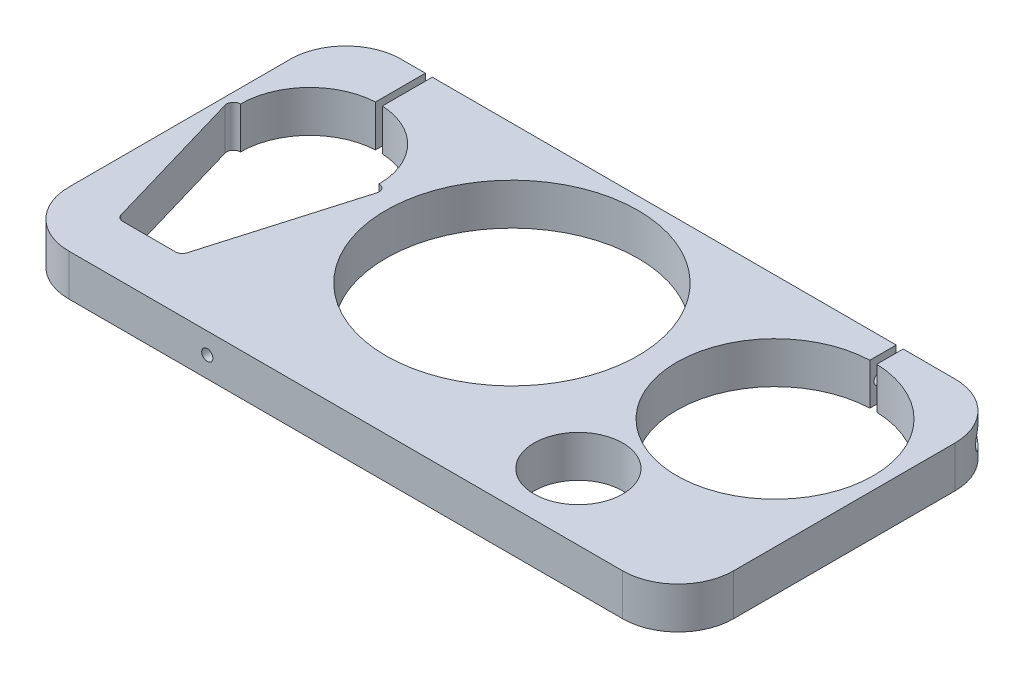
ISO-10303-21;
HEADER;
FILE_DESCRIPTION(('STEP AP214'),'2;1');
FILE_NAME('part.step','',(''),(''),'','','');
FILE_SCHEMA(('AUTOMOTIVE_DESIGN { 1 0 10303 214 1 1 1 1 }'));
ENDSEC;
DATA;
#1=APPLICATION_CONTEXT('core data for automotive mechanical design processes');
#2=APPLICATION_PROTOCOL_DEFINITION('international standard','automotive_design',2000,#1);
#3=PRODUCT_CONTEXT('',#1,'mechanical');
#4=PRODUCT('Part','Part','',(#3));
#5=PRODUCT_RELATED_PRODUCT_CATEGORY('part','',(#4));
#6=PRODUCT_DEFINITION_FORMATION('','',#4);
#7=PRODUCT_DEFINITION_CONTEXT('part definition',#1,'design');
#8=PRODUCT_DEFINITION('design','',#6,#7);
#9=PRODUCT_DEFINITION_SHAPE('','',#8);
#10=(LENGTH_UNIT() NAMED_UNIT(*) SI_UNIT(.MILLI.,.METRE.));
#11=(NAMED_UNIT(*) PLANE_ANGLE_UNIT() SI_UNIT($,.RADIAN.));
#12=(NAMED_UNIT(*) SI_UNIT($,.STERADIAN.) SOLID_ANGLE_UNIT());
#13=UNCERTAINTY_MEASURE_WITH_UNIT(LENGTH_MEASURE(1.E-05),#10,'distance_accuracy_value','');
#14=(GEOMETRIC_REPRESENTATION_CONTEXT(3) GLOBAL_UNCERTAINTY_ASSIGNED_CONTEXT((#13)) GLOBAL_UNIT_ASSIGNED_CONTEXT((#10,
#11,#12)) REPRESENTATION_CONTEXT('',''));
#15=CARTESIAN_POINT('',(0.,0.,0.));
#16=DIRECTION('',(0.,0.,1.));
#17=DIRECTION('',(1.,0.,0.));
#18=AXIS2_PLACEMENT_3D('',#15,#16,#17);
#19=CARTESIAN_POINT('',(25.4,-9.525,-152.4));
#20=DIRECTION('',(0.,0.,1.));
#21=DIRECTION('',(1.,0.,0.));
#22=AXIS2_PLACEMENT_3D('',#19,#20,#21);
#23=PLANE('',#22);
#24=DIRECTION('',(1.,0.,0.));
#25=VECTOR('',#24,1.);
#26=CARTESIAN_POINT('',(25.4,9.525,-152.4));
#27=LINE('',#26,#25);
#28=CARTESIAN_POINT('',(25.4,9.525,-152.4));
#29=VERTEX_POINT('',#28);
#30=CARTESIAN_POINT('',(36.5125,9.525,-152.4));
#31=VERTEX_POINT('',#30);
#32=EDGE_CURVE('E398',#29,#31,#27,.T.);
#33=ORIENTED_EDGE('',*,*,#32,.T.);
#34=DIRECTION('',(0.,1.,0.));
#35=VECTOR('',#34,1.);
#36=CARTESIAN_POINT('',(36.5125,-9.525,-152.4));
#37=LINE('',#36,#35);
#38=CARTESIAN_POINT('',(36.5125,-9.525,-152.4));
#39=VERTEX_POINT('',#38);
#40=EDGE_CURVE('E263',#39,#31,#37,.T.);
#41=ORIENTED_EDGE('',*,*,#40,.F.);
#42=DIRECTION('',(1.,0.,0.));
#43=VECTOR('',#42,1.);
#44=CARTESIAN_POINT('',(25.4,-9.525,-152.4));
#45=LINE('',#44,#43);
#46=CARTESIAN_POINT('',(25.4,-9.525,-152.4));
#47=VERTEX_POINT('',#46);
#48=EDGE_CURVE('E378',#47,#39,#45,.T.);
#49=ORIENTED_EDGE('',*,*,#48,.F.);
#50=DIRECTION('',(0.,1.,0.));
#51=VECTOR('',#50,1.);
#52=CARTESIAN_POINT('',(25.4,-9.525,-152.4));
#53=LINE('',#52,#51);
#54=EDGE_CURVE('E414',#47,#29,#53,.T.);
#55=ORIENTED_EDGE('',*,*,#54,.T.);
#56=EDGE_LOOP('',(#33,#41,#49,#55));
#57=FACE_BOUND('',#56,.T.);
#58=ADVANCED_FACE('F35',(#57),#23,.F.);
#59=CARTESIAN_POINT('',(190.5,0.,-152.4));
#60=DIRECTION('',(0.,0.,-1.));
#61=DIRECTION('',(-1.,0.,0.));
#62=AXIS2_PLACEMENT_3D('',#59,#60,#61);
#63=CIRCLE('',#62,2.55269999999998);
#64=CARTESIAN_POINT('',(187.9473,0.,-152.4));
#65=VERTEX_POINT('',#64);
#66=EDGE_CURVE('E332',#65,#65,#63,.T.);
#67=ORIENTED_EDGE('',*,*,#66,.F.);
#68=EDGE_LOOP('',(#67));
#69=FACE_BOUND('',#68,.T.);
#70=CARTESIAN_POINT('',(88.9,0.,-152.4));
#71=DIRECTION('',(0.,0.,-1.));
#72=DIRECTION('',(-1.,0.,0.));
#73=AXIS2_PLACEMENT_3D('',#70,#71,#72);
#74=CIRCLE('',#73,2.55270000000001);
#75=CARTESIAN_POINT('',(86.3473,0.,-152.4));
#76=VERTEX_POINT('',#75);
#77=EDGE_CURVE('E341',#76,#76,#74,.T.);
#78=ORIENTED_EDGE('',*,*,#77,.F.);
#79=EDGE_LOOP('',(#78));
#80=FACE_BOUND('',#79,.T.);
#81=CARTESIAN_POINT('',(39.6875,-9.525,-152.4));
#82=VERTEX_POINT('',#81);
#83=CARTESIAN_POINT('',(252.4125,-9.525,-152.4));
#84=VERTEX_POINT('',#83);
#85=EDGE_CURVE('E381',#82,#84,#45,.T.);
#86=ORIENTED_EDGE('',*,*,#85,.F.);
#87=DIRECTION('',(0.,1.,0.));
#88=VECTOR('',#87,1.);
#89=CARTESIAN_POINT('',(39.6875,-9.525,-152.4));
#90=LINE('',#89,#88);
#91=CARTESIAN_POINT('',(39.6875,9.525,-152.4));
#92=VERTEX_POINT('',#91);
#93=EDGE_CURVE('E266',#82,#92,#90,.T.);
#94=ORIENTED_EDGE('',*,*,#93,.T.);
#95=CARTESIAN_POINT('',(252.4125,9.525,-152.4));
#96=VERTEX_POINT('',#95);
#97=EDGE_CURVE('E402',#92,#96,#27,.T.);
#98=ORIENTED_EDGE('',*,*,#97,.T.);
#99=DIRECTION('',(0.,1.,0.));
#100=VECTOR('',#99,1.);
#101=CARTESIAN_POINT('',(252.4125,-9.525,-152.4));
#102=LINE('',#101,#100);
#103=EDGE_CURVE('E244',#84,#96,#102,.T.);
#104=ORIENTED_EDGE('',*,*,#103,.F.);
#105=EDGE_LOOP('',(#86,#94,#98,#104));
#106=FACE_BOUND('',#105,.T.);
#107=ADVANCED_FACE('F520',(#69,#80,#106),#23,.F.);
#108=CARTESIAN_POINT('',(38.1,-9.525,-97.79));
#109=DIRECTION('',(0.,1.,0.));
#110=DIRECTION('',(0.,0.,1.));
#111=AXIS2_PLACEMENT_3D('',#108,#109,#110);
#112=CYLINDRICAL_SURFACE('',#111,31.75);
#113=DIRECTION('',(0.,1.,0.));
#114=VECTOR('',#113,1.);
#115=CARTESIAN_POINT('',(36.5125,-9.525,-129.500287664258));
#116=LINE('',#115,#114);
#117=CARTESIAN_POINT('',(36.5125,9.525,-129.500287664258));
#118=VERTEX_POINT('',#117);
#119=CARTESIAN_POINT('',(36.5125,-9.525,-129.500287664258));
#120=VERTEX_POINT('',#119);
#121=EDGE_CURVE('E300',#118,#120,#116,.F.);
#122=ORIENTED_EDGE('',*,*,#121,.F.);
#123=CARTESIAN_POINT('',(38.1,9.525,-97.79));
#124=DIRECTION('',(0.,-1.,0.));
#125=DIRECTION('',(0.,0.,-1.));
#126=AXIS2_PLACEMENT_3D('',#123,#124,#125);
#127=CIRCLE('',#126,31.75);
#128=CARTESIAN_POINT('',(6.35000000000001,9.525,-97.79));
#129=VERTEX_POINT('',#128);
#130=EDGE_CURVE('E355',#129,#118,#127,.T.);
#131=ORIENTED_EDGE('',*,*,#130,.F.);
#132=DIRECTION('',(0.,1.,0.));
#133=VECTOR('',#132,1.);
#134=CARTESIAN_POINT('',(6.35000000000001,-9.525,-97.79));
#135=LINE('',#134,#133);
#136=CARTESIAN_POINT('',(6.35,-9.525,-97.79));
#137=VERTEX_POINT('',#136);
#138=EDGE_CURVE('E205',#137,#129,#135,.T.);
#139=ORIENTED_EDGE('',*,*,#138,.F.);
#140=CARTESIAN_POINT('',(38.1,-9.525,-97.79));
#141=DIRECTION('',(0.,-1.,0.));
#142=DIRECTION('',(0.,0.,-1.));
#143=AXIS2_PLACEMENT_3D('',#140,#141,#142);
#144=CIRCLE('',#143,31.75);
#145=EDGE_CURVE('E220',#137,#120,#144,.T.);
#146=ORIENTED_EDGE('',*,*,#145,.T.);
#147=EDGE_LOOP('',(#122,#131,#139,#146));
#148=FACE_BOUND('',#147,.T.);
#149=ADVANCED_FACE('F505',(#148),#112,.F.);
#150=CARTESIAN_POINT('',(279.4,-9.525,-25.4));
#151=DIRECTION('',(0.,1.,0.));
#152=DIRECTION('',(0.,0.,1.));
#153=AXIS2_PLACEMENT_3D('',#150,#151,#152);
#154=PLANE('',#153);
#155=CARTESIAN_POINT('',(228.6,-9.525,-30.48));
#156=DIRECTION('',(0.,1.,0.));
#157=DIRECTION('',(0.,0.,1.));
#158=AXIS2_PLACEMENT_3D('',#155,#156,#157);
#159=CIRCLE('',#158,20.32);
#160=CARTESIAN_POINT('',(228.6,-9.525,-10.16));
#161=VERTEX_POINT('',#160);
#162=EDGE_CURVE('E292',#161,#161,#159,.T.);
#163=ORIENTED_EDGE('',*,*,#162,.T.);
#164=EDGE_LOOP('',(#163));
#165=FACE_BOUND('',#164,.T.);
#166=CARTESIAN_POINT('',(139.7,-9.525,-88.9));
#167=DIRECTION('',(0.,-1.,0.));
#168=DIRECTION('',(0.,0.,-1.));
#169=AXIS2_PLACEMENT_3D('',#166,#167,#168);
#170=CIRCLE('',#169,57.785);
#171=CARTESIAN_POINT('',(139.7,-9.525,-146.685));
#172=VERTEX_POINT('',#171);
#173=EDGE_CURVE('E340',#172,#172,#170,.T.);
#174=ORIENTED_EDGE('',*,*,#173,.F.);
#175=EDGE_LOOP('',(#174));
#176=FACE_BOUND('',#175,.T.);
#177=ORIENTED_EDGE('',*,*,#48,.T.);
#178=DIRECTION('',(0.,0.,1.));
#179=VECTOR('',#178,1.);
#180=CARTESIAN_POINT('',(36.5125,-9.525,-152.4));
#181=LINE('',#180,#179);
#182=EDGE_CURVE('E221',#39,#120,#181,.T.);
#183=ORIENTED_EDGE('',*,*,#182,.T.);
#184=ORIENTED_EDGE('',*,*,#145,.F.);
#185=CARTESIAN_POINT('',(6.35000000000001,-9.525,-94.615));
#186=DIRECTION('',(0.,1.,0.));
#187=DIRECTION('',(0.,0.,1.));
#188=AXIS2_PLACEMENT_3D('',#185,#186,#187);
#189=CIRCLE('',#188,3.175);
#190=CARTESIAN_POINT('',(3.30264476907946,-9.525,-93.723792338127));
#191=VERTEX_POINT('',#190);
#192=EDGE_CURVE('E60',#137,#191,#189,.T.);
#193=ORIENTED_EDGE('',*,*,#192,.T.);
#194=DIRECTION('',(0.280695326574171,0.,0.959796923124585));
#195=VECTOR('',#194,1.);
#196=CARTESIAN_POINT('',(3.30264476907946,-9.525,-93.723792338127));
#197=LINE('',#196,#195);
#198=CARTESIAN_POINT('',(22.9876447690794,-9.525,-26.413792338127));
#199=VERTEX_POINT('',#198);
#200=EDGE_CURVE('E208',#191,#199,#197,.T.);
#201=ORIENTED_EDGE('',*,*,#200,.T.);
#202=CARTESIAN_POINT('',(26.035,-9.525,-27.305));
#203=DIRECTION('',(0.,1.,0.));
#204=DIRECTION('',(0.,0.,1.));
#205=AXIS2_PLACEMENT_3D('',#202,#203,#204);
#206=CIRCLE('',#205,3.17499999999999);
#207=CARTESIAN_POINT('',(26.035,-9.525,-24.13));
#208=VERTEX_POINT('',#207);
#209=EDGE_CURVE('E213',#199,#208,#206,.T.);
#210=ORIENTED_EDGE('',*,*,#209,.T.);
#211=DIRECTION('',(1.,0.,0.));
#212=VECTOR('',#211,1.);
#213=CARTESIAN_POINT('',(26.035,-9.525,-24.13));
#214=LINE('',#213,#212);
#215=CARTESIAN_POINT('',(50.165,-9.525,-24.13));
#216=VERTEX_POINT('',#215);
#217=EDGE_CURVE('E228',#208,#216,#214,.T.);
#218=ORIENTED_EDGE('',*,*,#217,.T.);
#219=CARTESIAN_POINT('',(50.165,-9.525,-27.305));
#220=DIRECTION('',(0.,1.,0.));
#221=DIRECTION('',(0.,0.,1.));
#222=AXIS2_PLACEMENT_3D('',#219,#220,#221);
#223=CIRCLE('',#222,3.17500000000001);
#224=CARTESIAN_POINT('',(53.2123552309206,-9.525,-26.413792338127));
#225=VERTEX_POINT('',#224);
#226=EDGE_CURVE('E231',#216,#225,#223,.T.);
#227=ORIENTED_EDGE('',*,*,#226,.T.);
#228=DIRECTION('',(0.280695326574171,0.,-0.959796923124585));
#229=VECTOR('',#228,1.);
#230=CARTESIAN_POINT('',(72.8973552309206,-9.525,-93.723792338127));
#231=LINE('',#230,#229);
#232=CARTESIAN_POINT('',(72.8973552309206,-9.525,-93.723792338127));
#233=VERTEX_POINT('',#232);
#234=EDGE_CURVE('E234',#225,#233,#231,.T.);
#235=ORIENTED_EDGE('',*,*,#234,.T.);
#236=CARTESIAN_POINT('',(69.85,-9.525,-94.615));
#237=DIRECTION('',(0.,1.,0.));
#238=DIRECTION('',(0.,0.,-1.));
#239=AXIS2_PLACEMENT_3D('',#236,#237,#238);
#240=CIRCLE('',#239,3.17500000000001);
#241=CARTESIAN_POINT('',(69.85,-9.525,-97.79));
#242=VERTEX_POINT('',#241);
#243=EDGE_CURVE('E237',#233,#242,#240,.T.);
#244=ORIENTED_EDGE('',*,*,#243,.T.);
#245=CARTESIAN_POINT('',(39.6875,-9.525,-129.500287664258));
#246=VERTEX_POINT('',#245);
#247=EDGE_CURVE('E358',#246,#242,#144,.T.);
#248=ORIENTED_EDGE('',*,*,#247,.F.);
#249=DIRECTION('',(0.,0.,-1.));
#250=VECTOR('',#249,1.);
#251=CARTESIAN_POINT('',(39.6875,-9.525,-152.4));
#252=LINE('',#251,#250);
#253=EDGE_CURVE('E240',#246,#82,#252,.T.);
#254=ORIENTED_EDGE('',*,*,#253,.T.);
#255=ORIENTED_EDGE('',*,*,#85,.T.);
#256=DIRECTION('',(0.,0.,1.));
#257=VECTOR('',#256,1.);
#258=CARTESIAN_POINT('',(252.4125,-9.525,-152.4));
#259=LINE('',#258,#257);
#260=CARTESIAN_POINT('',(252.4125,-9.525,-140.307042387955));
#261=VERTEX_POINT('',#260);
#262=EDGE_CURVE('E282',#84,#261,#259,.T.);
#263=ORIENTED_EDGE('',*,*,#262,.T.);
#264=CARTESIAN_POINT('',(254.,-9.525,-95.25));
#265=DIRECTION('',(0.,-1.,0.));
#266=DIRECTION('',(0.,0.,-1.));
#267=AXIS2_PLACEMENT_3D('',#264,#265,#266);
#268=CIRCLE('',#267,45.085);
#269=CARTESIAN_POINT('',(255.5875,-9.525,-140.307042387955));
#270=VERTEX_POINT('',#269);
#271=EDGE_CURVE('E352',#270,#261,#268,.T.);
#272=ORIENTED_EDGE('',*,*,#271,.F.);
#273=DIRECTION('',(0.,0.,-1.));
#274=VECTOR('',#273,1.);
#275=CARTESIAN_POINT('',(255.5875,-9.525,-152.4));
#276=LINE('',#275,#274);
#277=CARTESIAN_POINT('',(255.5875,-9.525,-152.4));
#278=VERTEX_POINT('',#277);
#279=EDGE_CURVE('E285',#270,#278,#276,.T.);
#280=ORIENTED_EDGE('',*,*,#279,.T.);
#281=CARTESIAN_POINT('',(279.4,-9.525,-152.4));
#282=VERTEX_POINT('',#281);
#283=EDGE_CURVE('E377',#278,#282,#45,.T.);
#284=ORIENTED_EDGE('',*,*,#283,.T.);
#285=CARTESIAN_POINT('',(279.4,-9.525,-127.));
#286=DIRECTION('',(0.,-1.,0.));
#287=DIRECTION('',(0.,0.,-1.));
#288=AXIS2_PLACEMENT_3D('',#285,#286,#287);
#289=CIRCLE('',#288,25.4);
#290=CARTESIAN_POINT('',(304.8,-9.525,-127.));
#291=VERTEX_POINT('',#290);
#292=EDGE_CURVE('E380',#282,#291,#289,.T.);
#293=ORIENTED_EDGE('',*,*,#292,.T.);
#294=DIRECTION('',(0.,0.,1.));
#295=VECTOR('',#294,1.);
#296=CARTESIAN_POINT('',(304.8,-9.525,-96.8375));
#297=LINE('',#296,#295);
#298=CARTESIAN_POINT('',(304.8,-9.525,-25.4));
#299=VERTEX_POINT('',#298);
#300=EDGE_CURVE('E383',#291,#299,#297,.T.);
#301=ORIENTED_EDGE('',*,*,#300,.T.);
#302=CARTESIAN_POINT('',(279.4,-9.525,-25.4));
#303=DIRECTION('',(0.,-1.,0.));
#304=DIRECTION('',(0.,0.,1.));
#305=AXIS2_PLACEMENT_3D('',#302,#303,#304);
#306=CIRCLE('',#305,25.4);
#307=CARTESIAN_POINT('',(279.4,-9.525,0.));
#308=VERTEX_POINT('',#307);
#309=EDGE_CURVE('E365',#299,#308,#306,.T.);
#310=ORIENTED_EDGE('',*,*,#309,.T.);
#311=DIRECTION('',(-1.,0.,0.));
#312=VECTOR('',#311,1.);
#313=CARTESIAN_POINT('',(25.4,-9.525,0.));
#314=LINE('',#313,#312);
#315=CARTESIAN_POINT('',(25.4,-9.525,0.));
#316=VERTEX_POINT('',#315);
#317=EDGE_CURVE('E368',#308,#316,#314,.T.);
#318=ORIENTED_EDGE('',*,*,#317,.T.);
#319=CARTESIAN_POINT('',(25.4,-9.525,-25.4));
#320=DIRECTION('',(0.,-1.,0.));
#321=DIRECTION('',(0.,0.,-1.));
#322=AXIS2_PLACEMENT_3D('',#319,#320,#321);
#323=CIRCLE('',#322,25.4);
#324=CARTESIAN_POINT('',(0.,-9.525,-25.4));
#325=VERTEX_POINT('',#324);
#326=EDGE_CURVE('E371',#316,#325,#323,.T.);
#327=ORIENTED_EDGE('',*,*,#326,.T.);
#328=DIRECTION('',(0.,0.,-1.));
#329=VECTOR('',#328,1.);
#330=CARTESIAN_POINT('',(0.,-9.525,-25.4));
#331=LINE('',#330,#329);
#332=CARTESIAN_POINT('',(0.,-9.525,-127.));
#333=VERTEX_POINT('',#332);
#334=EDGE_CURVE('E373',#325,#333,#331,.T.);
#335=ORIENTED_EDGE('',*,*,#334,.T.);
#336=CARTESIAN_POINT('',(25.4,-9.525,-127.));
#337=DIRECTION('',(0.,-1.,0.));
#338=DIRECTION('',(0.,0.,-1.));
#339=AXIS2_PLACEMENT_3D('',#336,#337,#338);
#340=CIRCLE('',#339,25.4);
#341=EDGE_CURVE('E375',#333,#47,#340,.T.);
#342=ORIENTED_EDGE('',*,*,#341,.T.);
#343=EDGE_LOOP('',(#177,#183,#184,#193,#201,#210,#218,#227,#235,#244,#248,#254,#255,#263,#272,
#280,#284,#293,#301,#310,#318,#327,#335,#342));
#344=FACE_BOUND('',#343,.T.);
#345=ADVANCED_FACE('F217',(#165,#176,#344),#154,.F.);
#346=CARTESIAN_POINT('',(279.4,9.525,-25.4));
#347=DIRECTION('',(0.,1.,0.));
#348=DIRECTION('',(0.,0.,1.));
#349=AXIS2_PLACEMENT_3D('',#346,#347,#348);
#350=PLANE('',#349);
#351=DIRECTION('',(0.,0.,1.));
#352=VECTOR('',#351,1.);
#353=CARTESIAN_POINT('',(36.5125,9.525,-152.4));
#354=LINE('',#353,#352);
#355=EDGE_CURVE('E52',#31,#118,#354,.T.);
#356=ORIENTED_EDGE('',*,*,#355,.F.);
#357=ORIENTED_EDGE('',*,*,#32,.F.);
#358=CARTESIAN_POINT('',(25.4,9.525,-127.));
#359=DIRECTION('',(0.,-1.,0.));
#360=DIRECTION('',(0.,0.,-1.));
#361=AXIS2_PLACEMENT_3D('',#358,#359,#360);
#362=CIRCLE('',#361,25.4);
#363=CARTESIAN_POINT('',(0.,9.525,-127.));
#364=VERTEX_POINT('',#363);
#365=EDGE_CURVE('E395',#364,#29,#362,.T.);
#366=ORIENTED_EDGE('',*,*,#365,.F.);
#367=DIRECTION('',(0.,0.,-1.));
#368=VECTOR('',#367,1.);
#369=CARTESIAN_POINT('',(0.,9.525,-96.8375));
#370=LINE('',#369,#368);
#371=CARTESIAN_POINT('',(0.,9.525,-25.4));
#372=VERTEX_POINT('',#371);
#373=EDGE_CURVE('E393',#372,#364,#370,.T.);
#374=ORIENTED_EDGE('',*,*,#373,.F.);
#375=CARTESIAN_POINT('',(25.4,9.525,-25.4));
#376=DIRECTION('',(0.,-1.,0.));
#377=DIRECTION('',(0.,0.,-1.));
#378=AXIS2_PLACEMENT_3D('',#375,#376,#377);
#379=CIRCLE('',#378,25.4);
#380=CARTESIAN_POINT('',(25.4,9.525,0.));
#381=VERTEX_POINT('',#380);
#382=EDGE_CURVE('E390',#381,#372,#379,.T.);
#383=ORIENTED_EDGE('',*,*,#382,.F.);
#384=DIRECTION('',(-1.,0.,0.));
#385=VECTOR('',#384,1.);
#386=CARTESIAN_POINT('',(25.4,9.525,0.));
#387=LINE('',#386,#385);
#388=CARTESIAN_POINT('',(279.4,9.525,0.));
#389=VERTEX_POINT('',#388);
#390=EDGE_CURVE('E388',#389,#381,#387,.T.);
#391=ORIENTED_EDGE('',*,*,#390,.F.);
#392=CARTESIAN_POINT('',(279.4,9.525,-25.4));
#393=DIRECTION('',(0.,-1.,0.));
#394=DIRECTION('',(0.,0.,1.));
#395=AXIS2_PLACEMENT_3D('',#392,#393,#394);
#396=CIRCLE('',#395,25.4);
#397=CARTESIAN_POINT('',(304.8,9.525,-25.4));
#398=VERTEX_POINT('',#397);
#399=EDGE_CURVE('E361',#398,#389,#396,.T.);
#400=ORIENTED_EDGE('',*,*,#399,.F.);
#401=DIRECTION('',(0.,0.,1.));
#402=VECTOR('',#401,1.);
#403=CARTESIAN_POINT('',(304.8,9.525,-25.4));
#404=LINE('',#403,#402);
#405=CARTESIAN_POINT('',(304.8,9.525,-127.));
#406=VERTEX_POINT('',#405);
#407=EDGE_CURVE('E369',#406,#398,#404,.T.);
#408=ORIENTED_EDGE('',*,*,#407,.F.);
#409=CARTESIAN_POINT('',(279.4,9.525,-127.));
#410=DIRECTION('',(0.,-1.,0.));
#411=DIRECTION('',(0.,0.,-1.));
#412=AXIS2_PLACEMENT_3D('',#409,#410,#411);
#413=CIRCLE('',#412,25.4);
#414=CARTESIAN_POINT('',(279.4,9.525,-152.4));
#415=VERTEX_POINT('',#414);
#416=EDGE_CURVE('E401',#415,#406,#413,.T.);
#417=ORIENTED_EDGE('',*,*,#416,.F.);
#418=CARTESIAN_POINT('',(255.5875,9.525,-152.4));
#419=VERTEX_POINT('',#418);
#420=EDGE_CURVE('E397',#419,#415,#27,.T.);
#421=ORIENTED_EDGE('',*,*,#420,.F.);
#422=DIRECTION('',(0.,0.,-1.));
#423=VECTOR('',#422,1.);
#424=CARTESIAN_POINT('',(255.5875,9.525,-152.4));
#425=LINE('',#424,#423);
#426=CARTESIAN_POINT('',(255.5875,9.525,-140.307042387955));
#427=VERTEX_POINT('',#426);
#428=EDGE_CURVE('E286',#427,#419,#425,.T.);
#429=ORIENTED_EDGE('',*,*,#428,.F.);
#430=CARTESIAN_POINT('',(254.,9.525,-95.25));
#431=DIRECTION('',(0.,-1.,0.));
#432=DIRECTION('',(0.,0.,-1.));
#433=AXIS2_PLACEMENT_3D('',#430,#431,#432);
#434=CIRCLE('',#433,45.085);
#435=CARTESIAN_POINT('',(252.4125,9.525,-140.307042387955));
#436=VERTEX_POINT('',#435);
#437=EDGE_CURVE('E351',#427,#436,#434,.T.);
#438=ORIENTED_EDGE('',*,*,#437,.T.);
#439=DIRECTION('',(0.,0.,1.));
#440=VECTOR('',#439,1.);
#441=CARTESIAN_POINT('',(252.4125,9.525,-152.4));
#442=LINE('',#441,#440);
#443=EDGE_CURVE('E290',#96,#436,#442,.T.);
#444=ORIENTED_EDGE('',*,*,#443,.F.);
#445=ORIENTED_EDGE('',*,*,#97,.F.);
#446=DIRECTION('',(0.,0.,-1.));
#447=VECTOR('',#446,1.);
#448=CARTESIAN_POINT('',(39.6875,9.525,-152.4));
#449=LINE('',#448,#447);
#450=CARTESIAN_POINT('',(39.6875,9.525,-129.500287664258));
#451=VERTEX_POINT('',#450);
#452=EDGE_CURVE('E223',#451,#92,#449,.T.);
#453=ORIENTED_EDGE('',*,*,#452,.F.);
#454=CARTESIAN_POINT('',(69.85,9.525,-97.79));
#455=VERTEX_POINT('',#454);
#456=EDGE_CURVE('E362',#451,#455,#127,.T.);
#457=ORIENTED_EDGE('',*,*,#456,.T.);
#458=CARTESIAN_POINT('',(69.85,9.525,-94.615));
#459=DIRECTION('',(0.,1.,0.));
#460=DIRECTION('',(0.,0.,-1.));
#461=AXIS2_PLACEMENT_3D('',#458,#459,#460);
#462=CIRCLE('',#461,3.17500000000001);
#463=CARTESIAN_POINT('',(72.8973552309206,9.525,-93.723792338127));
#464=VERTEX_POINT('',#463);
#465=EDGE_CURVE('E260',#464,#455,#462,.T.);
#466=ORIENTED_EDGE('',*,*,#465,.F.);
#467=DIRECTION('',(0.280695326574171,0.,-0.959796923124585));
#468=VECTOR('',#467,1.);
#469=CARTESIAN_POINT('',(72.8973552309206,9.525,-93.723792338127));
#470=LINE('',#469,#468);
#471=CARTESIAN_POINT('',(53.2123552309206,9.525,-26.413792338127));
#472=VERTEX_POINT('',#471);
#473=EDGE_CURVE('E257',#472,#464,#470,.T.);
#474=ORIENTED_EDGE('',*,*,#473,.F.);
#475=CARTESIAN_POINT('',(50.165,9.525,-27.305));
#476=DIRECTION('',(0.,1.,0.));
#477=DIRECTION('',(0.,0.,1.));
#478=AXIS2_PLACEMENT_3D('',#475,#476,#477);
#479=CIRCLE('',#478,3.17500000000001);
#480=CARTESIAN_POINT('',(50.165,9.525,-24.13));
#481=VERTEX_POINT('',#480);
#482=EDGE_CURVE('E254',#481,#472,#479,.T.);
#483=ORIENTED_EDGE('',*,*,#482,.F.);
#484=DIRECTION('',(1.,0.,0.));
#485=VECTOR('',#484,1.);
#486=CARTESIAN_POINT('',(26.035,9.525,-24.13));
#487=LINE('',#486,#485);
#488=CARTESIAN_POINT('',(26.035,9.525,-24.13));
#489=VERTEX_POINT('',#488);
#490=EDGE_CURVE('E251',#489,#481,#487,.T.);
#491=ORIENTED_EDGE('',*,*,#490,.F.);
#492=CARTESIAN_POINT('',(26.035,9.525,-27.305));
#493=DIRECTION('',(0.,1.,0.));
#494=DIRECTION('',(0.,0.,1.));
#495=AXIS2_PLACEMENT_3D('',#492,#493,#494);
#496=CIRCLE('',#495,3.17499999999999);
#497=CARTESIAN_POINT('',(22.9876447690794,9.525,-26.413792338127));
#498=VERTEX_POINT('',#497);
#499=EDGE_CURVE('E248',#498,#489,#496,.T.);
#500=ORIENTED_EDGE('',*,*,#499,.F.);
#501=DIRECTION('',(0.280695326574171,0.,0.959796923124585));
#502=VECTOR('',#501,1.);
#503=CARTESIAN_POINT('',(3.30264476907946,9.525,-93.723792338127));
#504=LINE('',#503,#502);
#505=CARTESIAN_POINT('',(3.30264476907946,9.525,-93.723792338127));
#506=VERTEX_POINT('',#505);
#507=EDGE_CURVE('E246',#506,#498,#504,.T.);
#508=ORIENTED_EDGE('',*,*,#507,.F.);
#509=CARTESIAN_POINT('',(6.35000000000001,9.525,-94.615));
#510=DIRECTION('',(0.,1.,0.));
#511=DIRECTION('',(0.,0.,1.));
#512=AXIS2_PLACEMENT_3D('',#509,#510,#511);
#513=CIRCLE('',#512,3.175);
#514=EDGE_CURVE('E200',#129,#506,#513,.T.);
#515=ORIENTED_EDGE('',*,*,#514,.F.);
#516=ORIENTED_EDGE('',*,*,#130,.T.);
#517=EDGE_LOOP('',(#356,#357,#366,#374,#383,#391,#400,#408,#417,#421,#429,#438,#444,#445,#453,
#457,#466,#474,#483,#491,#500,#508,#515,#516));
#518=FACE_BOUND('',#517,.T.);
#519=CARTESIAN_POINT('',(228.6,9.525,-30.48));
#520=DIRECTION('',(0.,1.,0.));
#521=DIRECTION('',(0.,0.,1.));
#522=AXIS2_PLACEMENT_3D('',#519,#520,#521);
#523=CIRCLE('',#522,20.32);
#524=CARTESIAN_POINT('',(228.6,9.525,-10.16));
#525=VERTEX_POINT('',#524);
#526=EDGE_CURVE('E961',#525,#525,#523,.T.);
#527=ORIENTED_EDGE('',*,*,#526,.F.);
#528=EDGE_LOOP('',(#527));
#529=FACE_BOUND('',#528,.T.);
#530=CARTESIAN_POINT('',(139.7,9.525,-88.9));
#531=DIRECTION('',(0.,1.,0.));
#532=DIRECTION('',(0.,0.,1.));
#533=AXIS2_PLACEMENT_3D('',#530,#531,#532);
#534=CIRCLE('',#533,57.785);
#535=CARTESIAN_POINT('',(139.7,9.525,-31.115));
#536=VERTEX_POINT('',#535);
#537=EDGE_CURVE('E265',#536,#536,#534,.T.);
#538=ORIENTED_EDGE('',*,*,#537,.F.);
#539=EDGE_LOOP('',(#538));
#540=FACE_BOUND('',#539,.T.);
#541=ADVANCED_FACE('F508',(#518,#529,#540),#350,.T.);
#542=CARTESIAN_POINT('',(279.4,-9.525,-25.4));
#543=DIRECTION('',(0.,1.,0.));
#544=DIRECTION('',(0.,0.,1.));
#545=AXIS2_PLACEMENT_3D('',#542,#543,#544);
#546=CYLINDRICAL_SURFACE('',#545,25.4);
#547=ORIENTED_EDGE('',*,*,#399,.T.);
#548=DIRECTION('',(0.,1.,0.));
#549=VECTOR('',#548,1.);
#550=CARTESIAN_POINT('',(279.4,-9.525,0.));
#551=LINE('',#550,#549);
#552=EDGE_CURVE('E11',#308,#389,#551,.T.);
#553=ORIENTED_EDGE('',*,*,#552,.F.);
#554=ORIENTED_EDGE('',*,*,#309,.F.);
#555=DIRECTION('',(0.,1.,0.));
#556=VECTOR('',#555,1.);
#557=CARTESIAN_POINT('',(304.8,-9.525,-25.4));
#558=LINE('',#557,#556);
#559=EDGE_CURVE('E385',#299,#398,#558,.T.);
#560=ORIENTED_EDGE('',*,*,#559,.T.);
#561=EDGE_LOOP('',(#547,#553,#554,#560));
#562=FACE_BOUND('',#561,.T.);
#563=ADVANCED_FACE('F37',(#562),#546,.T.);
#564=CARTESIAN_POINT('',(25.4,-9.525,0.));
#565=DIRECTION('',(0.,0.,-1.));
#566=DIRECTION('',(-1.,0.,0.));
#567=AXIS2_PLACEMENT_3D('',#564,#565,#566);
#568=PLANE('',#567);
#569=CARTESIAN_POINT('',(88.9,0.,0.));
#570=DIRECTION('',(0.,0.,1.));
#571=DIRECTION('',(1.,0.,0.));
#572=AXIS2_PLACEMENT_3D('',#569,#570,#571);
#573=CIRCLE('',#572,2.55269999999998);
#574=CARTESIAN_POINT('',(91.4527,0.,0.));
#575=VERTEX_POINT('',#574);
#576=EDGE_CURVE('E333',#575,#575,#573,.T.);
#577=ORIENTED_EDGE('',*,*,#576,.F.);
#578=EDGE_LOOP('',(#577));
#579=FACE_BOUND('',#578,.T.);
#580=ORIENTED_EDGE('',*,*,#390,.T.);
#581=DIRECTION('',(0.,1.,0.));
#582=VECTOR('',#581,1.);
#583=CARTESIAN_POINT('',(25.4,-9.525,0.));
#584=LINE('',#583,#582);
#585=EDGE_CURVE('E44',#316,#381,#584,.T.);
#586=ORIENTED_EDGE('',*,*,#585,.F.);
#587=ORIENTED_EDGE('',*,*,#317,.F.);
#588=ORIENTED_EDGE('',*,*,#552,.T.);
#589=EDGE_LOOP('',(#580,#586,#587,#588));
#590=FACE_BOUND('',#589,.T.);
#591=ADVANCED_FACE('F867',(#579,#590),#568,.F.);
#592=CARTESIAN_POINT('',(25.4,-9.525,-25.4));
#593=DIRECTION('',(0.,1.,0.));
#594=DIRECTION('',(0.,0.,1.));
#595=AXIS2_PLACEMENT_3D('',#592,#593,#594);
#596=CYLINDRICAL_SURFACE('',#595,25.4);
#597=ORIENTED_EDGE('',*,*,#382,.T.);
#598=DIRECTION('',(0.,1.,0.));
#599=VECTOR('',#598,1.);
#600=CARTESIAN_POINT('',(0.,-9.525,-25.4));
#601=LINE('',#600,#599);
#602=EDGE_CURVE('E420',#325,#372,#601,.T.);
#603=ORIENTED_EDGE('',*,*,#602,.F.);
#604=ORIENTED_EDGE('',*,*,#326,.F.);
#605=ORIENTED_EDGE('',*,*,#585,.T.);
#606=EDGE_LOOP('',(#597,#603,#604,#605));
#607=FACE_BOUND('',#606,.T.);
#608=ADVANCED_FACE('F856',(#607),#596,.T.);
#609=CARTESIAN_POINT('',(0.,-9.525,-96.8375));
#610=DIRECTION('',(1.,0.,0.));
#611=DIRECTION('',(0.,0.,-1.));
#612=AXIS2_PLACEMENT_3D('',#609,#610,#611);
#613=PLANE('',#612);
#614=ORIENTED_EDGE('',*,*,#373,.T.);
#615=DIRECTION('',(0.,1.,0.));
#616=VECTOR('',#615,1.);
#617=CARTESIAN_POINT('',(0.,-9.525,-127.));
#618=LINE('',#617,#616);
#619=EDGE_CURVE('E417',#333,#364,#618,.T.);
#620=ORIENTED_EDGE('',*,*,#619,.F.);
#621=ORIENTED_EDGE('',*,*,#334,.F.);
#622=ORIENTED_EDGE('',*,*,#602,.T.);
#623=EDGE_LOOP('',(#614,#620,#621,#622));
#624=FACE_BOUND('',#623,.T.);
#625=ADVANCED_FACE('F532',(#624),#613,.F.);
#626=CARTESIAN_POINT('',(25.4,-9.525,-127.));
#627=DIRECTION('',(0.,1.,0.));
#628=DIRECTION('',(0.,0.,1.));
#629=AXIS2_PLACEMENT_3D('',#626,#627,#628);
#630=CYLINDRICAL_SURFACE('',#629,25.4);
#631=CARTESIAN_POINT('',(7.2607717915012,-4.76249999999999,-144.78));
#632=CARTESIAN_POINT('',(7.45155453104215,-4.76250093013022,-144.974635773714));
#633=CARTESIAN_POINT('',(7.64548457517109,-4.75058069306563,-145.166202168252));
#634=CARTESIAN_POINT('',(8.0380738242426,-4.70498778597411,-145.541774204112));
#635=CARTESIAN_POINT('',(8.23673453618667,-4.67130809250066,-145.725777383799));
#636=CARTESIAN_POINT('',(8.637796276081,-4.58378722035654,-146.085630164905));
#637=CARTESIAN_POINT('',(8.84020490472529,-4.52989950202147,-146.261459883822));
#638=CARTESIAN_POINT('',(9.24691184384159,-4.40323994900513,-146.603785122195));
#639=CARTESIAN_POINT('',(9.45120986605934,-4.33047095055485,-146.770282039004));
#640=CARTESIAN_POINT('',(9.86535601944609,-4.16478510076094,-147.097416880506));
#641=CARTESIAN_POINT('',(10.075216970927,-4.07141635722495,-147.257809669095));
#642=CARTESIAN_POINT('',(10.493834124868,-3.86577880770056,-147.567791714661));
#643=CARTESIAN_POINT('',(10.702589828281,-3.75350210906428,-147.71737642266));
#644=CARTESIAN_POINT('',(11.1157960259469,-3.50998350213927,-148.004392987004));
#645=CARTESIAN_POINT('',(11.3202610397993,-3.37882416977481,-148.141873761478));
#646=CARTESIAN_POINT('',(11.7225146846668,-3.09566939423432,-148.404295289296));
#647=CARTESIAN_POINT('',(11.920310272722,-2.94369655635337,-148.529249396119));
#648=CARTESIAN_POINT('',(12.2542164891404,-2.65853691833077,-148.734217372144));
#649=CARTESIAN_POINT('',(12.3929705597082,-2.53077369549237,-148.817457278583));
#650=CARTESIAN_POINT('',(12.6610354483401,-2.25999141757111,-148.975051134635));
#651=CARTESIAN_POINT('',(12.7903342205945,-2.11695345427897,-149.049393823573));
#652=CARTESIAN_POINT('',(12.9735963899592,-1.88851660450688,-149.152867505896));
#653=CARTESIAN_POINT('',(13.0332176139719,-1.80955728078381,-149.18618847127));
#654=CARTESIAN_POINT('',(13.1475462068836,-1.64691778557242,-149.24953150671));
#655=CARTESIAN_POINT('',(13.2022526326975,-1.56323671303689,-149.279552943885));
#656=CARTESIAN_POINT('',(13.3568741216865,-1.30512121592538,-149.363737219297));
#657=CARTESIAN_POINT('',(13.4478361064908,-1.12296590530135,-149.412324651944));
#658=CARTESIAN_POINT('',(13.5655425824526,-0.810673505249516,-149.474616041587));
#659=CARTESIAN_POINT('',(13.6036008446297,-0.686056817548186,-149.494577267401));
#660=CARTESIAN_POINT('',(13.6611052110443,-0.431454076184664,-149.524640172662));
#661=CARTESIAN_POINT('',(13.6805770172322,-0.301475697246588,-149.534755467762));
#662=CARTESIAN_POINT('',(13.69866793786,-0.0390460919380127,-149.544155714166));
#663=CARTESIAN_POINT('',(13.6971928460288,0.0934136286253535,-149.543391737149));
#664=CARTESIAN_POINT('',(13.6733606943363,0.355944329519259,-149.53100275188));
#665=CARTESIAN_POINT('',(13.6509865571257,0.486013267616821,-149.519368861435));
#666=CARTESIAN_POINT('',(13.5815601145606,0.766008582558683,-149.483022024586));
#667=CARTESIAN_POINT('',(13.530425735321,0.914617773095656,-149.456136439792));
#668=CARTESIAN_POINT('',(13.4080466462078,1.20064547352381,-149.391020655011));
#669=CARTESIAN_POINT('',(13.3367595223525,1.33803958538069,-149.352766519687));
#670=CARTESIAN_POINT('',(13.1948461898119,1.5761027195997,-149.275535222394));
#671=CARTESIAN_POINT('',(13.1266800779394,1.67878240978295,-149.238083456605));
#672=CARTESIAN_POINT('',(12.9832061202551,1.8770674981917,-149.158293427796));
#673=CARTESIAN_POINT('',(12.9078935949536,1.97266818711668,-149.115951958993));
#674=CARTESIAN_POINT('',(12.7517493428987,2.15748015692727,-149.027025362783));
#675=CARTESIAN_POINT('',(12.6709065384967,2.24667783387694,-148.980431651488));
#676=CARTESIAN_POINT('',(12.5050953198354,2.41906612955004,-148.88357089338));
#677=CARTESIAN_POINT('',(12.420125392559,2.5022545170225,-148.833302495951));
#678=CARTESIAN_POINT('',(12.1736717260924,2.73133583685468,-148.685453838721));
#679=CARTESIAN_POINT('',(12.0083912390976,2.87059880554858,-148.583892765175));
#680=CARTESIAN_POINT('',(11.6712286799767,3.13280123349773,-148.371025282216));
#681=CARTESIAN_POINT('',(11.4993414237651,3.25572752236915,-148.259711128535));
#682=CARTESIAN_POINT('',(11.1514044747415,3.48683127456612,-148.028106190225));
#683=CARTESIAN_POINT('',(10.9753502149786,3.59499158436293,-147.907805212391));
#684=CARTESIAN_POINT('',(10.6211254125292,3.79721090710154,-147.65893827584));
#685=CARTESIAN_POINT('',(10.4429554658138,3.89127379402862,-147.530374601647));
#686=CARTESIAN_POINT('',(10.0720699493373,4.07235993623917,-147.255169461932));
#687=CARTESIAN_POINT('',(9.8792872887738,4.1582892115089,-147.107897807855));
#688=CARTESIAN_POINT('',(9.49408184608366,4.31410444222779,-146.804592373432));
#689=CARTESIAN_POINT('',(9.30165911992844,4.38398807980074,-146.648557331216));
#690=CARTESIAN_POINT('',(8.91856061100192,4.50704622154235,-146.328332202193));
#691=CARTESIAN_POINT('',(8.72788339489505,4.56023590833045,-146.164149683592));
#692=CARTESIAN_POINT('',(8.34925810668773,4.648994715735,-145.828070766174));
#693=CARTESIAN_POINT('',(8.16130958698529,4.68456675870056,-145.656175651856));
#694=CARTESIAN_POINT('',(7.81321328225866,4.73339204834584,-145.327972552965));
#695=CARTESIAN_POINT('',(7.65259717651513,4.74892628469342,-145.172500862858));
#696=CARTESIAN_POINT('',(7.33513450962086,4.76449788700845,-144.856951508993));
#697=CARTESIAN_POINT('',(7.17828804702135,4.76453484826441,-144.696873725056));
#698=CARTESIAN_POINT('',(6.86940581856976,4.74785540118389,-144.373170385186));
#699=CARTESIAN_POINT('',(6.71736638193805,4.73115211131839,-144.209547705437));
#700=CARTESIAN_POINT('',(6.4190739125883,4.67965828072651,-143.879985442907));
#701=CARTESIAN_POINT('',(6.27281930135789,4.64487271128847,-143.714046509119));
#702=CARTESIAN_POINT('',(5.91030441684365,4.53177259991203,-143.291868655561));
#703=CARTESIAN_POINT('',(5.69865736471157,4.44011189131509,-143.035021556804));
#704=CARTESIAN_POINT('',(5.29672920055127,4.20574577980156,-142.528133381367));
#705=CARTESIAN_POINT('',(5.1064200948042,4.0631083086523,-142.27808372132));
#706=CARTESIAN_POINT('',(4.78379197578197,3.75365914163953,-141.838888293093));
#707=CARTESIAN_POINT('',(4.6471732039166,3.59561315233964,-141.646803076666));
#708=CARTESIAN_POINT('',(4.45826823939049,3.33131906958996,-141.374150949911));
#709=CARTESIAN_POINT('',(4.39794644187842,3.23863471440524,-141.285809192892));
#710=CARTESIAN_POINT('',(4.28302074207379,3.04443250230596,-141.115371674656));
#711=CARTESIAN_POINT('',(4.2284143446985,2.94291853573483,-141.033273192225));
#712=CARTESIAN_POINT('',(4.12489962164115,2.73067156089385,-140.875844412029));
#713=CARTESIAN_POINT('',(4.07603676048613,2.6198755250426,-140.800569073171));
#714=CARTESIAN_POINT('',(3.98485603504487,2.39041132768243,-140.658650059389));
#715=CARTESIAN_POINT('',(3.94253496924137,2.27174705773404,-140.592002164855));
#716=CARTESIAN_POINT('',(3.86473239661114,2.02736078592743,-140.468392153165));
#717=CARTESIAN_POINT('',(3.82924961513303,1.90164010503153,-140.411428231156));
#718=CARTESIAN_POINT('',(3.7653845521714,1.64416504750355,-140.30815940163));
#719=CARTESIAN_POINT('',(3.73700124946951,1.51241154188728,-140.261852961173));
#720=CARTESIAN_POINT('',(3.69057542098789,1.2605259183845,-140.185697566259));
#721=CARTESIAN_POINT('',(3.67169231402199,1.14094586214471,-140.15452781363));
#722=CARTESIAN_POINT('',(3.63966466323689,0.898992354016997,-140.10147965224));
#723=CARTESIAN_POINT('',(3.62651955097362,0.776619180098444,-140.079600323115));
#724=CARTESIAN_POINT('',(3.60604729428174,0.530107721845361,-140.045459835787));
#725=CARTESIAN_POINT('',(3.59871782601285,0.405970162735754,-140.033194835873));
#726=CARTESIAN_POINT('',(3.58991059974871,0.156908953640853,-140.018451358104));
#727=CARTESIAN_POINT('',(3.5884326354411,0.031985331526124,-140.015972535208));
#728=CARTESIAN_POINT('',(3.59123390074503,-0.208830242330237,-140.020665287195));
#729=CARTESIAN_POINT('',(3.59511621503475,-0.324740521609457,-140.027171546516));
#730=CARTESIAN_POINT('',(3.60792824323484,-0.555539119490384,-140.04859244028));
#731=CARTESIAN_POINT('',(3.61685957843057,-0.670427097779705,-140.063509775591));
#732=CARTESIAN_POINT('',(3.63972046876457,-0.898268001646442,-140.101554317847));
#733=CARTESIAN_POINT('',(3.65364748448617,-1.01122187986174,-140.124677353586));
#734=CARTESIAN_POINT('',(3.68643566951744,-1.23452211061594,-140.178851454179));
#735=CARTESIAN_POINT('',(3.70529868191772,-1.34486747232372,-140.209905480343));
#736=CARTESIAN_POINT('',(3.7478621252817,-1.5621831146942,-140.279555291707));
#737=CARTESIAN_POINT('',(3.77156206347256,-1.66915373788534,-140.318150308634));
#738=CARTESIAN_POINT('',(3.82367903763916,-1.87909722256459,-140.402418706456));
#739=CARTESIAN_POINT('',(3.85209775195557,-1.98206864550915,-140.448094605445));
#740=CARTESIAN_POINT('',(3.94422007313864,-2.2840321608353,-140.594957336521));
#741=CARTESIAN_POINT('',(4.01482499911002,-2.47625283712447,-140.706037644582));
#742=CARTESIAN_POINT('',(4.17777417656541,-2.84967018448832,-140.957105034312));
#743=CARTESIAN_POINT('',(4.27118017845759,-3.02948340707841,-141.098440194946));
#744=CARTESIAN_POINT('',(4.47510828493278,-3.36200623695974,-141.399372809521));
#745=CARTESIAN_POINT('',(4.58563606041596,-3.51470682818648,-141.558976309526));
#746=CARTESIAN_POINT('',(4.83620894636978,-3.8092188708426,-141.911159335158));
#747=CARTESIAN_POINT('',(4.97821240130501,-3.94738309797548,-142.105380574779));
#748=CARTESIAN_POINT('',(5.27821127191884,-4.18924627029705,-142.5027624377));
#749=CARTESIAN_POINT('',(5.43621867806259,-4.29291912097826,-142.705929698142));
#750=CARTESIAN_POINT('',(5.72647517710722,-4.44707463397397,-143.067136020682));
#751=CARTESIAN_POINT('',(5.85602257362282,-4.50433427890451,-143.224530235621));
#752=CARTESIAN_POINT('',(6.12170273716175,-4.60100843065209,-143.539336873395));
#753=CARTESIAN_POINT('',(6.25783822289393,-4.64041549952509,-143.69674927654));
#754=CARTESIAN_POINT('',(6.53582094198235,-4.70259298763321,-144.010194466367));
#755=CARTESIAN_POINT('',(6.67767666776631,-4.72533763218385,-144.166224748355));
#756=CARTESIAN_POINT('',(6.96597791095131,-4.75529069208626,-144.475455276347));
#757=CARTESIAN_POINT('',(7.11242337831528,-4.76249927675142,-144.628655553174));
#758=CARTESIAN_POINT('',(7.2607717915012,-4.76249999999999,-144.78));
#759=B_SPLINE_CURVE_WITH_KNOTS('',3,(#631,#632,#633,#634,#635,#636,#637,#638,#639,#640,#641,
#642,#643,#644,#645,#646,#647,#648,#649,#650,#651,#652,#653,#654,#655,#656,#657,#658,#659,#660,
#661,#662,#663,#664,#665,#666,#667,#668,#669,#670,#671,#672,#673,#674,#675,#676,#677,#678,#679,
#680,#681,#682,#683,#684,#685,#686,#687,#688,#689,#690,#691,#692,#693,#694,#695,#696,#697,#698,
#699,#700,#701,#702,#703,#704,#705,#706,#707,#708,#709,#710,#711,#712,#713,#714,#715,#716,#717,
#718,#719,#720,#721,#722,#723,#724,#725,#726,#727,#728,#729,#730,#731,#732,#733,#734,#735,#736,
#737,#738,#739,#740,#741,#742,#743,#744,#745,#746,#747,#748,#749,#750,#751,#752,#753,#754,#755,
#756,#757,#758),.UNSPECIFIED.,.T.,.F.,(4,2,2,2,2,2,2,2,2,2,2,2,2,2,2,2,2,2,2,2,2,2,2,2,2,2,2,2,
2,2,2,2,2,2,2,2,2,2,2,2,2,2,2,2,2,2,2,2,2,2,2,2,2,2,2,2,2,2,2,2,2,2,2,4),(0.,0.817413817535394,
1.63509160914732,2.4546642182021,3.27411378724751,4.11373625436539,4.95371007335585,
5.79011628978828,6.62562119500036,7.24341585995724,7.86198434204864,8.17492933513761,
8.48793425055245,9.11126906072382,9.50525536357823,9.89869605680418,10.2939067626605,
10.6894406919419,11.1651265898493,11.641821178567,12.0277239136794,12.4138811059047,
12.8008358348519,13.187933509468,13.9032026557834,14.6190449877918,15.3357119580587,
16.0521816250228,16.8236271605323,17.5951840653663,18.36603721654,19.1367624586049,
19.8084261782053,20.4801074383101,21.1512627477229,21.8222336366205,22.8537543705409,
23.8839055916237,24.7314693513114,25.1556408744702,25.5796264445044,26.0067696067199,
26.4337030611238,26.8605568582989,27.2873492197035,27.6618893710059,28.0363924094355,
28.4107457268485,28.7850858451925,29.1331443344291,29.4813146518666,29.8293082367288,
30.1774319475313,30.5255202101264,30.8737325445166,31.569588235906,32.3078048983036,
33.0462665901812,33.875523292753,34.7054059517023,35.3397719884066,35.9744020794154,
36.6100118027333,37.2456145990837),.UNSPECIFIED.);
#760=CARTESIAN_POINT('',(7.2607717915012,-4.76249999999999,-144.78));
#761=VERTEX_POINT('',#760);
#762=EDGE_CURVE('E336',#761,#761,#759,.T.);
#763=ORIENTED_EDGE('',*,*,#762,.T.);
#764=EDGE_LOOP('',(#763));
#765=FACE_BOUND('',#764,.T.);
#766=ORIENTED_EDGE('',*,*,#365,.T.);
#767=ORIENTED_EDGE('',*,*,#54,.F.);
#768=ORIENTED_EDGE('',*,*,#341,.F.);
#769=ORIENTED_EDGE('',*,*,#619,.T.);
#770=EDGE_LOOP('',(#766,#767,#768,#769));
#771=FACE_BOUND('',#770,.T.);
#772=ADVANCED_FACE('F527',(#765,#771),#630,.T.);
#773=ORIENTED_EDGE('',*,*,#283,.F.);
#774=DIRECTION('',(0.,1.,0.));
#775=VECTOR('',#774,1.);
#776=CARTESIAN_POINT('',(255.5875,-9.525,-152.4));
#777=LINE('',#776,#775);
#778=EDGE_CURVE('E289',#278,#419,#777,.T.);
#779=ORIENTED_EDGE('',*,*,#778,.T.);
#780=ORIENTED_EDGE('',*,*,#420,.T.);
#781=DIRECTION('',(0.,1.,0.));
#782=VECTOR('',#781,1.);
#783=CARTESIAN_POINT('',(279.4,-9.525,-152.4));
#784=LINE('',#783,#782);
#785=EDGE_CURVE('E411',#282,#415,#784,.T.);
#786=ORIENTED_EDGE('',*,*,#785,.F.);
#787=EDGE_LOOP('',(#773,#779,#780,#786));
#788=FACE_BOUND('',#787,.T.);
#789=ADVANCED_FACE('F517',(#788),#23,.F.);
#790=CARTESIAN_POINT('',(279.4,-9.525,-127.));
#791=DIRECTION('',(0.,1.,0.));
#792=DIRECTION('',(0.,0.,1.));
#793=AXIS2_PLACEMENT_3D('',#790,#791,#792);
#794=CYLINDRICAL_SURFACE('',#793,25.4);
#795=CARTESIAN_POINT('',(297.539228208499,-4.76249999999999,-144.78));
#796=CARTESIAN_POINT('',(297.680408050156,-4.76249920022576,-144.635968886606));
#797=CARTESIAN_POINT('',(297.819863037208,-4.75596978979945,-144.490258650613));
#798=CARTESIAN_POINT('',(298.094619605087,-4.72889554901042,-144.196268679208));
#799=CARTESIAN_POINT('',(298.229922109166,-4.70835385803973,-144.047989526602));
#800=CARTESIAN_POINT('',(298.495521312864,-4.65224277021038,-143.749950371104));
#801=CARTESIAN_POINT('',(298.625821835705,-4.61668511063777,-143.600191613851));
#802=CARTESIAN_POINT('',(298.880584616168,-4.52954854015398,-143.300478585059));
#803=CARTESIAN_POINT('',(299.005048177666,-4.47797322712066,-143.15052436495));
#804=CARTESIAN_POINT('',(299.317222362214,-4.32297270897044,-142.765647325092));
#805=CARTESIAN_POINT('',(299.500035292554,-4.20679663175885,-142.531571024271));
#806=CARTESIAN_POINT('',(299.758263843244,-3.99859054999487,-142.18952796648));
#807=CARTESIAN_POINT('',(299.841679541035,-3.92352584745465,-142.077018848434));
#808=CARTESIAN_POINT('',(300.002692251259,-3.76187109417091,-141.856232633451));
#809=CARTESIAN_POINT('',(300.080292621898,-3.67528777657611,-141.747953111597));
#810=CARTESIAN_POINT('',(300.217917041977,-3.50447031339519,-141.552882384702));
#811=CARTESIAN_POINT('',(300.278829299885,-3.42184112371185,-141.465308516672));
#812=CARTESIAN_POINT('',(300.395687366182,-3.24839640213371,-141.295165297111));
#813=CARTESIAN_POINT('',(300.451635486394,-3.15758472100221,-141.212593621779));
#814=CARTESIAN_POINT('',(300.558272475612,-2.96796771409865,-141.053351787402));
#815=CARTESIAN_POINT('',(300.60895955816,-2.86915969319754,-140.976683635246));
#816=CARTESIAN_POINT('',(300.704713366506,-2.66402747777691,-140.830286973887));
#817=CARTESIAN_POINT('',(300.74978248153,-2.55770650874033,-140.76055551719));
#818=CARTESIAN_POINT('',(300.834291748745,-2.33740090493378,-140.628548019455));
#819=CARTESIAN_POINT('',(300.87369538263,-2.22337295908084,-140.566320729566));
#820=CARTESIAN_POINT('',(300.94625676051,-1.98904826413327,-140.450779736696));
#821=CARTESIAN_POINT('',(300.979417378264,-1.86875443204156,-140.397461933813));
#822=CARTESIAN_POINT('',(301.039286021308,-1.62276927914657,-140.300546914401));
#823=CARTESIAN_POINT('',(301.065994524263,-1.49707835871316,-140.256948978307));
#824=CARTESIAN_POINT('',(301.112776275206,-1.24135302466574,-140.180188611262));
#825=CARTESIAN_POINT('',(301.132850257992,-1.1113190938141,-140.147025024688));
#826=CARTESIAN_POINT('',(301.164484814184,-0.861836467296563,-140.094580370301));
#827=CARTESIAN_POINT('',(301.176715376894,-0.742699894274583,-140.07421145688));
#828=CARTESIAN_POINT('',(301.195680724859,-0.50279491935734,-140.042570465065));
#829=CARTESIAN_POINT('',(301.202415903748,-0.382026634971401,-140.031297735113));
#830=CARTESIAN_POINT('',(301.210352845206,-0.139841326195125,-140.018009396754));
#831=CARTESIAN_POINT('',(301.211556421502,-0.0184245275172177,-140.015990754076));
#832=CARTESIAN_POINT('',(301.208428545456,0.224136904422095,-140.021230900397));
#833=CARTESIAN_POINT('',(301.204097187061,0.345281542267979,-140.028489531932));
#834=CARTESIAN_POINT('',(301.190273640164,0.58039215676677,-140.051595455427));
#835=CARTESIAN_POINT('',(301.1810465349,0.694417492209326,-140.067001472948));
#836=CARTESIAN_POINT('',(301.157654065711,0.920601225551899,-140.105914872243));
#837=CARTESIAN_POINT('',(301.143487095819,1.03275900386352,-140.129424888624));
#838=CARTESIAN_POINT('',(301.110292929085,1.25436292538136,-140.184240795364));
#839=CARTESIAN_POINT('',(301.091267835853,1.36381021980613,-140.215543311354));
#840=CARTESIAN_POINT('',(301.048442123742,1.57938183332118,-140.285580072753));
#841=CARTESIAN_POINT('',(301.02463971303,1.68550488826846,-140.324317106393));
#842=CARTESIAN_POINT('',(300.971951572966,1.895459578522,-140.409453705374));
#843=CARTESIAN_POINT('',(300.942989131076,1.99922542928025,-140.455968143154));
#844=CARTESIAN_POINT('',(300.880404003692,2.20206405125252,-140.555652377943));
#845=CARTESIAN_POINT('',(300.846779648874,2.30113512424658,-140.608824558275));
#846=CARTESIAN_POINT('',(300.739168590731,2.59047832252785,-140.777431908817));
#847=CARTESIAN_POINT('',(300.658404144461,2.77303860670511,-140.902023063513));
#848=CARTESIAN_POINT('',(300.473644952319,3.12745512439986,-141.180671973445));
#849=CARTESIAN_POINT('',(300.368341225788,3.29740797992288,-141.336259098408));
#850=CARTESIAN_POINT('',(300.140920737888,3.60816423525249,-141.663352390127));
#851=CARTESIAN_POINT('',(300.018797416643,3.74895620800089,-141.834864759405));
#852=CARTESIAN_POINT('',(299.741906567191,4.01896627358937,-142.212791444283));
#853=CARTESIAN_POINT('',(299.584962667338,4.14379797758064,-142.420728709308));
#854=CARTESIAN_POINT('',(299.255436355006,4.35712637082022,-142.842771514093));
#855=CARTESIAN_POINT('',(299.082842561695,4.44559635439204,-143.056881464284));
#856=CARTESIAN_POINT('',(298.767840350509,4.57171879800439,-143.434478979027));
#857=CARTESIAN_POINT('',(298.628049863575,4.61645880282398,-143.597861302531));
#858=CARTESIAN_POINT('',(298.342278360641,4.68776750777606,-143.923267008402));
#859=CARTESIAN_POINT('',(298.196294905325,4.71432897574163,-144.085289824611));
#860=CARTESIAN_POINT('',(297.89900000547,4.75061113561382,-144.406752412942));
#861=CARTESIAN_POINT('',(297.747680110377,4.76030376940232,-144.566187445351));
#862=CARTESIAN_POINT('',(297.440880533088,4.76402973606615,-144.881134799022));
#863=CARTESIAN_POINT('',(297.285400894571,4.75806323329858,-145.03664716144));
#864=CARTESIAN_POINT('',(296.923781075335,4.72762463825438,-145.389087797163));
#865=CARTESIAN_POINT('',(296.716476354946,4.6981237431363,-145.58439551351));
#866=CARTESIAN_POINT('',(296.297843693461,4.61662700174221,-145.965841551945));
#867=CARTESIAN_POINT('',(296.086514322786,4.56462301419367,-146.151976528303));
#868=CARTESIAN_POINT('',(295.661071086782,4.43956556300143,-146.514502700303));
#869=CARTESIAN_POINT('',(295.44695285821,4.36647400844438,-146.690875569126));
#870=CARTESIAN_POINT('',(295.017970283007,4.20027542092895,-147.032828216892));
#871=CARTESIAN_POINT('',(294.803106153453,4.10717379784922,-147.198410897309));
#872=CARTESIAN_POINT('',(294.407085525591,3.91692356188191,-147.493872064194));
#873=CARTESIAN_POINT('',(294.225780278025,3.8225519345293,-147.625347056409));
#874=CARTESIAN_POINT('',(293.865229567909,3.61928397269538,-147.879794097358));
#875=CARTESIAN_POINT('',(293.685984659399,3.51038382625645,-148.00276390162));
#876=CARTESIAN_POINT('',(293.332195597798,3.27772641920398,-148.23909097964));
#877=CARTESIAN_POINT('',(293.157634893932,3.15403332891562,-148.352486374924));
#878=CARTESIAN_POINT('',(292.815176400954,2.88996946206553,-148.569283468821));
#879=CARTESIAN_POINT('',(292.647272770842,2.74961375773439,-148.672694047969));
#880=CARTESIAN_POINT('',(292.349570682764,2.4749579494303,-148.851625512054));
#881=CARTESIAN_POINT('',(292.218115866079,2.34361623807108,-148.928910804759));
#882=CARTESIAN_POINT('',(291.966152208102,2.06529659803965,-149.074258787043));
#883=CARTESIAN_POINT('',(291.845662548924,1.91829220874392,-149.14230541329));
#884=CARTESIAN_POINT('',(291.677343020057,1.68356712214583,-149.235806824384));
#885=CARTESIAN_POINT('',(291.622956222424,1.60231068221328,-149.265731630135));
#886=CARTESIAN_POINT('',(291.519862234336,1.43502493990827,-149.322015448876));
#887=CARTESIAN_POINT('',(291.471156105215,1.34899475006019,-149.348373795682));
#888=CARTESIAN_POINT('',(291.381011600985,1.17244599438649,-149.396829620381));
#889=CARTESIAN_POINT('',(291.339546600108,1.08194551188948,-149.4189427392));
#890=CARTESIAN_POINT('',(291.265309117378,0.89649133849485,-149.458321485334));
#891=CARTESIAN_POINT('',(291.232529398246,0.801541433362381,-149.475591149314));
#892=CARTESIAN_POINT('',(291.170228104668,0.582881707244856,-149.508293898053));
#893=CARTESIAN_POINT('',(291.143697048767,0.458040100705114,-149.522120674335));
#894=CARTESIAN_POINT('',(291.109799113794,0.205132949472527,-149.539764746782));
#895=CARTESIAN_POINT('',(291.102414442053,0.0770705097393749,-149.543591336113));
#896=CARTESIAN_POINT('',(291.107660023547,-0.178618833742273,-149.540867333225));
#897=CARTESIAN_POINT('',(291.120304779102,-0.306245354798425,-149.534309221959));
#898=CARTESIAN_POINT('',(291.164133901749,-0.557378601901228,-149.511457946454));
#899=CARTESIAN_POINT('',(291.195337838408,-0.680880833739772,-149.495154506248));
#900=CARTESIAN_POINT('',(291.28723108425,-0.964451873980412,-149.446765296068));
#901=CARTESIAN_POINT('',(291.354480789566,-1.12175489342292,-149.411116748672));
#902=CARTESIAN_POINT('',(291.509395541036,-1.4225093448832,-149.327790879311));
#903=CARTESIAN_POINT('',(291.597112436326,-1.56592426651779,-149.280082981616));
#904=CARTESIAN_POINT('',(291.77253211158,-1.81930760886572,-149.183079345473));
#905=CARTESIAN_POINT('',(291.858354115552,-1.93109785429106,-149.135040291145));
#906=CARTESIAN_POINT('',(292.037401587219,-2.14590521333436,-149.033308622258));
#907=CARTESIAN_POINT('',(292.130632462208,-2.24891580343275,-148.979611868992));
#908=CARTESIAN_POINT('',(292.322636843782,-2.44715457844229,-148.867278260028));
#909=CARTESIAN_POINT('',(292.421421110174,-2.54236671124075,-148.808631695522));
#910=CARTESIAN_POINT('',(292.622977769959,-2.72556377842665,-148.687017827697));
#911=CARTESIAN_POINT('',(292.725751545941,-2.81354617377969,-148.624049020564));
#912=CARTESIAN_POINT('',(293.016757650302,-3.04994715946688,-148.442765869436));
#913=CARTESIAN_POINT('',(293.208233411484,-3.19107012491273,-148.320100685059));
#914=CARTESIAN_POINT('',(293.596575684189,-3.45452449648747,-148.06351251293));
#915=CARTESIAN_POINT('',(293.793446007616,-3.5768421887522,-147.929581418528));
#916=CARTESIAN_POINT('',(294.190126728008,-3.80395379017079,-147.651172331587));
#917=CARTESIAN_POINT('',(294.389939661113,-3.90873148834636,-147.506684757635));
#918=CARTESIAN_POINT('',(294.790395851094,-4.10102251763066,-147.207873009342));
#919=CARTESIAN_POINT('',(294.991038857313,-4.18854072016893,-147.053551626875));
#920=CARTESIAN_POINT('',(295.39188280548,-4.34619796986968,-146.73537973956));
#921=CARTESIAN_POINT('',(295.592083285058,-4.41632351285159,-146.571521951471));
#922=CARTESIAN_POINT('',(295.990590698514,-4.53837050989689,-146.234872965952));
#923=CARTESIAN_POINT('',(296.188897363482,-4.59028941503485,-146.062080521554));
#924=CARTESIAN_POINT('',(296.582000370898,-4.67463797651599,-145.708517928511));
#925=CARTESIAN_POINT('',(296.776801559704,-4.70709692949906,-145.527760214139));
#926=CARTESIAN_POINT('',(297.161821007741,-4.75102510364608,-145.158984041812));
#927=CARTESIAN_POINT('',(297.352040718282,-4.76250106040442,-144.970967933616));
#928=CARTESIAN_POINT('',(297.539228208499,-4.76249999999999,-144.78));
#929=B_SPLINE_CURVE_WITH_KNOTS('',3,(#795,#796,#797,#798,#799,#800,#801,#802,#803,#804,#805,
#806,#807,#808,#809,#810,#811,#812,#813,#814,#815,#816,#817,#818,#819,#820,#821,#822,#823,#824,
#825,#826,#827,#828,#829,#830,#831,#832,#833,#834,#835,#836,#837,#838,#839,#840,#841,#842,#843,
#844,#845,#846,#847,#848,#849,#850,#851,#852,#853,#854,#855,#856,#857,#858,#859,#860,#861,#862,
#863,#864,#865,#866,#867,#868,#869,#870,#871,#872,#873,#874,#875,#876,#877,#878,#879,#880,#881,
#882,#883,#884,#885,#886,#887,#888,#889,#890,#891,#892,#893,#894,#895,#896,#897,#898,#899,#900,
#901,#902,#903,#904,#905,#906,#907,#908,#909,#910,#911,#912,#913,#914,#915,#916,#917,#918,#919,
#920,#921,#922,#923,#924,#925,#926,#927,#928),.UNSPECIFIED.,.T.,.F.,(4,2,2,2,2,2,2,2,2,2,2,2,2,
2,2,2,2,2,2,2,2,2,2,2,2,2,2,2,2,2,2,2,2,2,2,2,2,2,2,2,2,2,2,2,2,2,2,2,2,2,2,2,2,2,2,2,2,2,2,2,2,
2,2,2,2,2,4),(0.,0.604899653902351,1.20966382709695,1.81395615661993,2.41811284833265,
3.37051979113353,3.84678205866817,4.32276714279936,4.72716923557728,5.13138199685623,
5.53573156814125,5.9399085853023,6.34658407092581,6.75307189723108,7.15952962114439,
7.56594231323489,7.92992712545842,8.29388586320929,8.65772525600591,9.02155847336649,
9.3674464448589,9.71344697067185,10.059297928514,10.4052788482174,10.756913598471,
11.1086745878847,11.8116755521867,12.5687490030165,13.3261185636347,14.1896167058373,
15.0537479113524,15.7117901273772,16.3700939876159,17.0294917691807,17.6888826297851,
18.5467143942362,19.4048567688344,20.2645590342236,21.1240291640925,21.8525725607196,
22.5813074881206,23.3069886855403,24.0320183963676,24.6349905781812,25.2389980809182,
25.5454991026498,25.85205729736,26.1574633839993,26.4626141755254,26.8460080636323,
27.2290455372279,27.6123604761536,27.9960803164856,28.5173793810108,29.0400136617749,
29.4860770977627,29.9324691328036,30.3797580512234,30.8272033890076,31.6288717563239,
32.4311220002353,33.2341096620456,34.0368703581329,34.8402524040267,35.6437468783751,
36.4460286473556,37.2480528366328),.UNSPECIFIED.);
#930=CARTESIAN_POINT('',(297.539228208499,-4.76249999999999,-144.78));
#931=VERTEX_POINT('',#930);
#932=EDGE_CURVE('E321',#931,#931,#929,.T.);
#933=ORIENTED_EDGE('',*,*,#932,.T.);
#934=EDGE_LOOP('',(#933));
#935=FACE_BOUND('',#934,.T.);
#936=ORIENTED_EDGE('',*,*,#416,.T.);
#937=DIRECTION('',(0.,1.,0.));
#938=VECTOR('',#937,1.);
#939=CARTESIAN_POINT('',(304.8,-9.525,-127.));
#940=LINE('',#939,#938);
#941=EDGE_CURVE('E408',#291,#406,#940,.T.);
#942=ORIENTED_EDGE('',*,*,#941,.F.);
#943=ORIENTED_EDGE('',*,*,#292,.F.);
#944=ORIENTED_EDGE('',*,*,#785,.T.);
#945=EDGE_LOOP('',(#936,#942,#943,#944));
#946=FACE_BOUND('',#945,.T.);
#947=ADVANCED_FACE('F438',(#935,#946),#794,.T.);
#948=CARTESIAN_POINT('',(304.8,-9.525,-25.4));
#949=DIRECTION('',(-1.,0.,0.));
#950=DIRECTION('',(0.,0.,1.));
#951=AXIS2_PLACEMENT_3D('',#948,#949,#950);
#952=PLANE('',#951);
#953=ORIENTED_EDGE('',*,*,#407,.T.);
#954=ORIENTED_EDGE('',*,*,#559,.F.);
#955=ORIENTED_EDGE('',*,*,#300,.F.);
#956=ORIENTED_EDGE('',*,*,#941,.T.);
#957=EDGE_LOOP('',(#953,#954,#955,#956));
#958=FACE_BOUND('',#957,.T.);
#959=ADVANCED_FACE('F503',(#958),#952,.F.);
#960=DIRECTION('',(0.,1.,0.));
#961=VECTOR('',#960,1.);
#962=CARTESIAN_POINT('',(39.6875,-9.525,-129.500287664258));
#963=LINE('',#962,#961);
#964=EDGE_CURVE('E303',#246,#451,#963,.T.);
#965=ORIENTED_EDGE('',*,*,#964,.F.);
#966=ORIENTED_EDGE('',*,*,#247,.T.);
#967=DIRECTION('',(0.,1.,0.));
#968=VECTOR('',#967,1.);
#969=CARTESIAN_POINT('',(69.85,-9.525,-97.79));
#970=LINE('',#969,#968);
#971=EDGE_CURVE('E269',#242,#455,#970,.T.);
#972=ORIENTED_EDGE('',*,*,#971,.T.);
#973=ORIENTED_EDGE('',*,*,#456,.F.);
#974=EDGE_LOOP('',(#965,#966,#972,#973));
#975=FACE_BOUND('',#974,.T.);
#976=ADVANCED_FACE('F499',(#975),#112,.F.);
#977=CARTESIAN_POINT('',(254.,-9.525,-95.25));
#978=DIRECTION('',(0.,1.,0.));
#979=DIRECTION('',(0.,0.,1.));
#980=AXIS2_PLACEMENT_3D('',#977,#978,#979);
#981=CYLINDRICAL_SURFACE('',#980,45.085);
#982=DIRECTION('',(0.,1.,0.));
#983=VECTOR('',#982,1.);
#984=CARTESIAN_POINT('',(252.4125,-9.525,-140.307042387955));
#985=LINE('',#984,#983);
#986=EDGE_CURVE('E308',#436,#261,#985,.F.);
#987=ORIENTED_EDGE('',*,*,#986,.F.);
#988=ORIENTED_EDGE('',*,*,#437,.F.);
#989=DIRECTION('',(0.,1.,0.));
#990=VECTOR('',#989,1.);
#991=CARTESIAN_POINT('',(255.5875,-9.525,-140.307042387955));
#992=LINE('',#991,#990);
#993=EDGE_CURVE('E306',#270,#427,#992,.T.);
#994=ORIENTED_EDGE('',*,*,#993,.F.);
#995=ORIENTED_EDGE('',*,*,#271,.T.);
#996=EDGE_LOOP('',(#987,#988,#994,#995));
#997=FACE_BOUND('',#996,.T.);
#998=ADVANCED_FACE('F495',(#997),#981,.F.);
#999=CARTESIAN_POINT('',(139.7,-8.7376,-88.9));
#1000=DIRECTION('',(0.,-1.,0.));
#1001=DIRECTION('',(0.,0.,-1.));
#1002=AXIS2_PLACEMENT_3D('',#999,#1000,#1001);
#1003=CYLINDRICAL_SURFACE('',#1002,57.785);
#1004=ORIENTED_EDGE('',*,*,#173,.T.);
#1005=EDGE_LOOP('',(#1004));
#1006=FACE_BOUND('',#1005,.T.);
#1007=ORIENTED_EDGE('',*,*,#537,.T.);
#1008=EDGE_LOOP('',(#1007));
#1009=FACE_BOUND('',#1008,.T.);
#1010=ADVANCED_FACE('F491',(#1006,#1009),#1003,.F.);
#1011=CARTESIAN_POINT('',(190.5,0.,-134.62));
#1012=DIRECTION('',(0.,0.,-1.));
#1013=DIRECTION('',(-1.,0.,0.));
#1014=AXIS2_PLACEMENT_3D('',#1011,#1012,#1013);
#1015=CYLINDRICAL_SURFACE('',#1014,2.55269999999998);
#1016=CARTESIAN_POINT('',(190.5,0.,-134.62));
#1017=DIRECTION('',(0.,0.,-1.));
#1018=DIRECTION('',(-1.,0.,0.));
#1019=AXIS2_PLACEMENT_3D('',#1016,#1017,#1018);
#1020=CIRCLE('',#1019,2.55269999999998);
#1021=CARTESIAN_POINT('',(187.9473,0.,-134.62));
#1022=VERTEX_POINT('',#1021);
#1023=EDGE_CURVE('E344',#1022,#1022,#1020,.T.);
#1024=ORIENTED_EDGE('',*,*,#1023,.F.);
#1025=EDGE_LOOP('',(#1024));
#1026=FACE_BOUND('',#1025,.T.);
#1027=ORIENTED_EDGE('',*,*,#66,.T.);
#1028=EDGE_LOOP('',(#1027));
#1029=FACE_BOUND('',#1028,.T.);
#1030=ADVANCED_FACE('F487',(#1026,#1029),#1015,.F.);
#1031=CARTESIAN_POINT('',(190.5,0.,-134.62));
#1032=DIRECTION('',(0.,0.,-1.));
#1033=DIRECTION('',(-1.,0.,0.));
#1034=AXIS2_PLACEMENT_3D('',#1031,#1032,#1033);
#1035=PLANE('',#1034);
#1036=ORIENTED_EDGE('',*,*,#1023,.T.);
#1037=EDGE_LOOP('',(#1036));
#1038=FACE_BOUND('',#1037,.T.);
#1039=ADVANCED_FACE('F483',(#1038),#1035,.T.);
#1040=CARTESIAN_POINT('',(88.9,0.,-134.62));
#1041=DIRECTION('',(0.,0.,-1.));
#1042=DIRECTION('',(-1.,0.,0.));
#1043=AXIS2_PLACEMENT_3D('',#1040,#1041,#1042);
#1044=CYLINDRICAL_SURFACE('',#1043,2.55270000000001);
#1045=CARTESIAN_POINT('',(88.9,0.,-134.62));
#1046=DIRECTION('',(0.,0.,-1.));
#1047=DIRECTION('',(-1.,0.,0.));
#1048=AXIS2_PLACEMENT_3D('',#1045,#1046,#1047);
#1049=CIRCLE('',#1048,2.55270000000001);
#1050=CARTESIAN_POINT('',(86.3473,0.,-134.62));
#1051=VERTEX_POINT('',#1050);
#1052=EDGE_CURVE('E337',#1051,#1051,#1049,.T.);
#1053=ORIENTED_EDGE('',*,*,#1052,.F.);
#1054=EDGE_LOOP('',(#1053));
#1055=FACE_BOUND('',#1054,.T.);
#1056=ORIENTED_EDGE('',*,*,#77,.T.);
#1057=EDGE_LOOP('',(#1056));
#1058=FACE_BOUND('',#1057,.T.);
#1059=ADVANCED_FACE('F479',(#1055,#1058),#1044,.F.);
#1060=CARTESIAN_POINT('',(88.9,0.,-134.62));
#1061=DIRECTION('',(0.,0.,-1.));
#1062=DIRECTION('',(-1.,0.,0.));
#1063=AXIS2_PLACEMENT_3D('',#1060,#1061,#1062);
#1064=PLANE('',#1063);
#1065=ORIENTED_EDGE('',*,*,#1052,.T.);
#1066=EDGE_LOOP('',(#1065));
#1067=FACE_BOUND('',#1066,.T.);
#1068=ADVANCED_FACE('F475',(#1067),#1064,.T.);
#1069=CARTESIAN_POINT('',(88.9,0.,-22.86));
#1070=DIRECTION('',(0.,0.,1.));
#1071=DIRECTION('',(1.,0.,0.));
#1072=AXIS2_PLACEMENT_3D('',#1069,#1070,#1071);
#1073=CYLINDRICAL_SURFACE('',#1072,2.55269999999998);
#1074=CARTESIAN_POINT('',(88.9,0.,-22.86));
#1075=DIRECTION('',(0.,0.,1.));
#1076=DIRECTION('',(1.,0.,0.));
#1077=AXIS2_PLACEMENT_3D('',#1074,#1075,#1076);
#1078=CIRCLE('',#1077,2.55269999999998);
#1079=CARTESIAN_POINT('',(91.4527,0.,-22.86));
#1080=VERTEX_POINT('',#1079);
#1081=EDGE_CURVE('E329',#1080,#1080,#1078,.T.);
#1082=ORIENTED_EDGE('',*,*,#1081,.F.);
#1083=EDGE_LOOP('',(#1082));
#1084=FACE_BOUND('',#1083,.T.);
#1085=ORIENTED_EDGE('',*,*,#576,.T.);
#1086=EDGE_LOOP('',(#1085));
#1087=FACE_BOUND('',#1086,.T.);
#1088=ADVANCED_FACE('F471',(#1084,#1087),#1073,.F.);
#1089=CARTESIAN_POINT('',(88.9,0.,-22.86));
#1090=DIRECTION('',(0.,0.,1.));
#1091=DIRECTION('',(1.,0.,0.));
#1092=AXIS2_PLACEMENT_3D('',#1089,#1090,#1091);
#1093=PLANE('',#1092);
#1094=ORIENTED_EDGE('',*,*,#1081,.T.);
#1095=EDGE_LOOP('',(#1094));
#1096=FACE_BOUND('',#1095,.T.);
#1097=ADVANCED_FACE('F448',(#1096),#1093,.T.);
#1098=CARTESIAN_POINT('',(-26.5007490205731,0.,-144.78));
#1099=DIRECTION('',(-1.,0.,0.));
#1100=DIRECTION('',(0.,-1.,0.));
#1101=AXIS2_PLACEMENT_3D('',#1098,#1099,#1100);
#1102=CYLINDRICAL_SURFACE('',#1101,4.76250000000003);
#1103=CARTESIAN_POINT('',(273.05,0.,-144.78));
#1104=DIRECTION('',(-1.,0.,0.));
#1105=DIRECTION('',(0.,-1.,0.));
#1106=AXIS2_PLACEMENT_3D('',#1103,#1104,#1105);
#1107=CIRCLE('',#1106,4.76250000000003);
#1108=CARTESIAN_POINT('',(273.05,-4.76249999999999,-144.78));
#1109=VERTEX_POINT('',#1108);
#1110=EDGE_CURVE('E310',#1109,#1109,#1107,.T.);
#1111=ORIENTED_EDGE('',*,*,#1110,.T.);
#1112=EDGE_LOOP('',(#1111));
#1113=FACE_BOUND('',#1112,.T.);
#1114=ORIENTED_EDGE('',*,*,#932,.F.);
#1115=EDGE_LOOP('',(#1114));
#1116=FACE_BOUND('',#1115,.T.);
#1117=ADVANCED_FACE('F442',(#1113,#1116),#1102,.F.);
#1118=CARTESIAN_POINT('',(-26.5007490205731,0.,-144.78));
#1119=DIRECTION('',(-1.,0.,0.));
#1120=DIRECTION('',(0.,-1.,0.));
#1121=AXIS2_PLACEMENT_3D('',#1118,#1119,#1120);
#1122=CYLINDRICAL_SURFACE('',#1121,3.26390000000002);
#1123=CARTESIAN_POINT('',(255.5875,0.,-144.78));
#1124=DIRECTION('',(1.,0.,0.));
#1125=DIRECTION('',(0.,0.,-1.));
#1126=AXIS2_PLACEMENT_3D('',#1123,#1124,#1125);
#1127=CIRCLE('',#1126,3.26390000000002);
#1128=CARTESIAN_POINT('',(255.5875,0.,-148.0439));
#1129=VERTEX_POINT('',#1128);
#1130=EDGE_CURVE('E305',#1129,#1129,#1127,.F.);
#1131=ORIENTED_EDGE('',*,*,#1130,.T.);
#1132=EDGE_LOOP('',(#1131));
#1133=FACE_BOUND('',#1132,.T.);
#1134=CARTESIAN_POINT('',(273.05,0.,-144.78));
#1135=DIRECTION('',(-1.,0.,0.));
#1136=DIRECTION('',(0.,-1.,0.));
#1137=AXIS2_PLACEMENT_3D('',#1134,#1135,#1136);
#1138=CIRCLE('',#1137,3.26390000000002);
#1139=CARTESIAN_POINT('',(273.05,-3.26389999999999,-144.78));
#1140=VERTEX_POINT('',#1139);
#1141=EDGE_CURVE('E324',#1140,#1140,#1138,.T.);
#1142=ORIENTED_EDGE('',*,*,#1141,.F.);
#1143=EDGE_LOOP('',(#1142));
#1144=FACE_BOUND('',#1143,.T.);
#1145=ADVANCED_FACE('F447',(#1133,#1144),#1122,.F.);
#1146=CARTESIAN_POINT('',(273.05,-3.26389999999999,-144.78));
#1147=DIRECTION('',(-1.,0.,0.));
#1148=DIRECTION('',(0.,-1.,0.));
#1149=AXIS2_PLACEMENT_3D('',#1146,#1147,#1148);
#1150=PLANE('',#1149);
#1151=ORIENTED_EDGE('',*,*,#1110,.F.);
#1152=EDGE_LOOP('',(#1151));
#1153=FACE_BOUND('',#1152,.T.);
#1154=ORIENTED_EDGE('',*,*,#1141,.T.);
#1155=EDGE_LOOP('',(#1154));
#1156=FACE_BOUND('',#1155,.T.);
#1157=ADVANCED_FACE('F452',(#1153,#1156),#1150,.F.);
#1158=CARTESIAN_POINT('',(-26.5007490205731,0.,-144.78));
#1159=DIRECTION('',(-1.,0.,0.));
#1160=DIRECTION('',(0.,-1.,0.));
#1161=AXIS2_PLACEMENT_3D('',#1158,#1159,#1160);
#1162=CYLINDRICAL_SURFACE('',#1161,4.7625);
#1163=CARTESIAN_POINT('',(19.05,0.,-144.78));
#1164=DIRECTION('',(-1.,0.,0.));
#1165=DIRECTION('',(0.,-1.,0.));
#1166=AXIS2_PLACEMENT_3D('',#1163,#1164,#1165);
#1167=CIRCLE('',#1166,4.7625);
#1168=CARTESIAN_POINT('',(19.05,-4.76249999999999,-144.78));
#1169=VERTEX_POINT('',#1168);
#1170=EDGE_CURVE('E311',#1169,#1169,#1167,.T.);
#1171=ORIENTED_EDGE('',*,*,#1170,.F.);
#1172=EDGE_LOOP('',(#1171));
#1173=FACE_BOUND('',#1172,.T.);
#1174=ORIENTED_EDGE('',*,*,#762,.F.);
#1175=EDGE_LOOP('',(#1174));
#1176=FACE_BOUND('',#1175,.T.);
#1177=ADVANCED_FACE('F455',(#1173,#1176),#1162,.F.);
#1178=CARTESIAN_POINT('',(-26.5007490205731,0.,-144.78));
#1179=DIRECTION('',(-1.,0.,0.));
#1180=DIRECTION('',(0.,-1.,0.));
#1181=AXIS2_PLACEMENT_3D('',#1178,#1179,#1180);
#1182=CYLINDRICAL_SURFACE('',#1181,3.2639);
#1183=CARTESIAN_POINT('',(36.5125,0.,-144.78));
#1184=DIRECTION('',(-1.,0.,0.));
#1185=DIRECTION('',(0.,0.,1.));
#1186=AXIS2_PLACEMENT_3D('',#1183,#1184,#1185);
#1187=CIRCLE('',#1186,3.2639);
#1188=CARTESIAN_POINT('',(36.5125,0.,-141.5161));
#1189=VERTEX_POINT('',#1188);
#1190=EDGE_CURVE('E299',#1189,#1189,#1187,.F.);
#1191=ORIENTED_EDGE('',*,*,#1190,.T.);
#1192=EDGE_LOOP('',(#1191));
#1193=FACE_BOUND('',#1192,.T.);
#1194=CARTESIAN_POINT('',(19.05,0.,-144.78));
#1195=DIRECTION('',(-1.,0.,0.));
#1196=DIRECTION('',(0.,-1.,0.));
#1197=AXIS2_PLACEMENT_3D('',#1194,#1195,#1196);
#1198=CIRCLE('',#1197,3.2639);
#1199=CARTESIAN_POINT('',(19.05,-3.26389999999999,-144.78));
#1200=VERTEX_POINT('',#1199);
#1201=EDGE_CURVE('E314',#1200,#1200,#1198,.T.);
#1202=ORIENTED_EDGE('',*,*,#1201,.T.);
#1203=EDGE_LOOP('',(#1202));
#1204=FACE_BOUND('',#1203,.T.);
#1205=ADVANCED_FACE('F569',(#1193,#1204),#1182,.F.);
#1206=CARTESIAN_POINT('',(19.05,-3.26389999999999,-144.78));
#1207=DIRECTION('',(1.,0.,0.));
#1208=DIRECTION('',(0.,1.,0.));
#1209=AXIS2_PLACEMENT_3D('',#1206,#1207,#1208);
#1210=PLANE('',#1209);
#1211=ORIENTED_EDGE('',*,*,#1201,.F.);
#1212=EDGE_LOOP('',(#1211));
#1213=FACE_BOUND('',#1212,.T.);
#1214=ORIENTED_EDGE('',*,*,#1170,.T.);
#1215=EDGE_LOOP('',(#1214));
#1216=FACE_BOUND('',#1215,.T.);
#1217=ADVANCED_FACE('F574',(#1213,#1216),#1210,.F.);
#1218=CARTESIAN_POINT('',(36.5125,-9.525,-152.4));
#1219=DIRECTION('',(-1.,0.,0.));
#1220=DIRECTION('',(0.,0.,1.));
#1221=AXIS2_PLACEMENT_3D('',#1218,#1219,#1220);
#1222=PLANE('',#1221);
#1223=ORIENTED_EDGE('',*,*,#121,.T.);
#1224=ORIENTED_EDGE('',*,*,#182,.F.);
#1225=ORIENTED_EDGE('',*,*,#40,.T.);
#1226=ORIENTED_EDGE('',*,*,#355,.T.);
#1227=EDGE_LOOP('',(#1223,#1224,#1225,#1226));
#1228=FACE_BOUND('',#1227,.T.);
#1229=ORIENTED_EDGE('',*,*,#1190,.F.);
#1230=EDGE_LOOP('',(#1229));
#1231=FACE_BOUND('',#1230,.T.);
#1232=ADVANCED_FACE('F572',(#1228,#1231),#1222,.F.);
#1233=CARTESIAN_POINT('',(39.6875,-9.525,-152.4));
#1234=DIRECTION('',(1.,0.,0.));
#1235=DIRECTION('',(0.,0.,-1.));
#1236=AXIS2_PLACEMENT_3D('',#1233,#1234,#1235);
#1237=PLANE('',#1236);
#1238=ORIENTED_EDGE('',*,*,#964,.T.);
#1239=ORIENTED_EDGE('',*,*,#452,.T.);
#1240=ORIENTED_EDGE('',*,*,#93,.F.);
#1241=ORIENTED_EDGE('',*,*,#253,.F.);
#1242=EDGE_LOOP('',(#1238,#1239,#1240,#1241));
#1243=FACE_BOUND('',#1242,.T.);
#1244=CARTESIAN_POINT('',(39.6875,0.,-144.78));
#1245=DIRECTION('',(1.,0.,0.));
#1246=DIRECTION('',(0.,0.,-1.));
#1247=AXIS2_PLACEMENT_3D('',#1244,#1245,#1246);
#1248=CIRCLE('',#1247,2.5527);
#1249=CARTESIAN_POINT('',(39.6875,0.,-147.3327));
#1250=VERTEX_POINT('',#1249);
#1251=EDGE_CURVE('E302',#1250,#1250,#1248,.F.);
#1252=ORIENTED_EDGE('',*,*,#1251,.F.);
#1253=EDGE_LOOP('',(#1252));
#1254=FACE_BOUND('',#1253,.T.);
#1255=ADVANCED_FACE('F560',(#1243,#1254),#1237,.F.);
#1256=CARTESIAN_POINT('',(255.5875,-9.525,-152.4));
#1257=DIRECTION('',(1.,0.,0.));
#1258=DIRECTION('',(0.,0.,-1.));
#1259=AXIS2_PLACEMENT_3D('',#1256,#1257,#1258);
#1260=PLANE('',#1259);
#1261=ORIENTED_EDGE('',*,*,#993,.T.);
#1262=ORIENTED_EDGE('',*,*,#428,.T.);
#1263=ORIENTED_EDGE('',*,*,#778,.F.);
#1264=ORIENTED_EDGE('',*,*,#279,.F.);
#1265=EDGE_LOOP('',(#1261,#1262,#1263,#1264));
#1266=FACE_BOUND('',#1265,.T.);
#1267=ORIENTED_EDGE('',*,*,#1130,.F.);
#1268=EDGE_LOOP('',(#1267));
#1269=FACE_BOUND('',#1268,.T.);
#1270=ADVANCED_FACE('F557',(#1266,#1269),#1260,.F.);
#1271=CARTESIAN_POINT('',(252.4125,-9.525,-152.4));
#1272=DIRECTION('',(-1.,0.,0.));
#1273=DIRECTION('',(0.,0.,1.));
#1274=AXIS2_PLACEMENT_3D('',#1271,#1272,#1273);
#1275=PLANE('',#1274);
#1276=ORIENTED_EDGE('',*,*,#986,.T.);
#1277=ORIENTED_EDGE('',*,*,#262,.F.);
#1278=ORIENTED_EDGE('',*,*,#103,.T.);
#1279=ORIENTED_EDGE('',*,*,#443,.T.);
#1280=EDGE_LOOP('',(#1276,#1277,#1278,#1279));
#1281=FACE_BOUND('',#1280,.T.);
#1282=CARTESIAN_POINT('',(252.4125,0.,-144.78));
#1283=DIRECTION('',(-1.,0.,0.));
#1284=DIRECTION('',(0.,0.,1.));
#1285=AXIS2_PLACEMENT_3D('',#1282,#1283,#1284);
#1286=CIRCLE('',#1285,2.55270000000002);
#1287=CARTESIAN_POINT('',(252.4125,0.,-142.2273));
#1288=VERTEX_POINT('',#1287);
#1289=EDGE_CURVE('E39',#1288,#1288,#1286,.F.);
#1290=ORIENTED_EDGE('',*,*,#1289,.F.);
#1291=EDGE_LOOP('',(#1290));
#1292=FACE_BOUND('',#1291,.T.);
#1293=ADVANCED_FACE('F548',(#1281,#1292),#1275,.F.);
#1294=CARTESIAN_POINT('',(69.85,-9.525,-94.615));
#1295=DIRECTION('',(0.,1.,0.));
#1296=DIRECTION('',(0.,0.,1.));
#1297=AXIS2_PLACEMENT_3D('',#1294,#1295,#1296);
#1298=CYLINDRICAL_SURFACE('',#1297,3.17500000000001);
#1299=ORIENTED_EDGE('',*,*,#465,.T.);
#1300=ORIENTED_EDGE('',*,*,#971,.F.);
#1301=ORIENTED_EDGE('',*,*,#243,.F.);
#1302=DIRECTION('',(0.,1.,0.));
#1303=VECTOR('',#1302,1.);
#1304=CARTESIAN_POINT('',(72.8973552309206,-9.525,-93.723792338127));
#1305=LINE('',#1304,#1303);
#1306=EDGE_CURVE('E272',#233,#464,#1305,.T.);
#1307=ORIENTED_EDGE('',*,*,#1306,.T.);
#1308=EDGE_LOOP('',(#1299,#1300,#1301,#1307));
#1309=FACE_BOUND('',#1308,.T.);
#1310=ADVANCED_FACE('F588',(#1309),#1298,.F.);
#1311=CARTESIAN_POINT('',(72.8973552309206,-9.525,-93.723792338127));
#1312=DIRECTION('',(0.959796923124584,0.,0.280695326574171));
#1313=DIRECTION('',(0.280695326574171,0.,-0.959796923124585));
#1314=AXIS2_PLACEMENT_3D('',#1311,#1312,#1313);
#1315=PLANE('',#1314);
#1316=ORIENTED_EDGE('',*,*,#473,.T.);
#1317=ORIENTED_EDGE('',*,*,#1306,.F.);
#1318=ORIENTED_EDGE('',*,*,#234,.F.);
#1319=DIRECTION('',(0.,1.,0.));
#1320=VECTOR('',#1319,1.);
#1321=CARTESIAN_POINT('',(53.2123552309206,-9.525,-26.413792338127));
#1322=LINE('',#1321,#1320);
#1323=EDGE_CURVE('E274',#225,#472,#1322,.T.);
#1324=ORIENTED_EDGE('',*,*,#1323,.T.);
#1325=EDGE_LOOP('',(#1316,#1317,#1318,#1324));
#1326=FACE_BOUND('',#1325,.T.);
#1327=ADVANCED_FACE('F618',(#1326),#1315,.F.);
#1328=CARTESIAN_POINT('',(50.165,-9.525,-27.305));
#1329=DIRECTION('',(0.,1.,0.));
#1330=DIRECTION('',(0.,0.,1.));
#1331=AXIS2_PLACEMENT_3D('',#1328,#1329,#1330);
#1332=CYLINDRICAL_SURFACE('',#1331,3.17500000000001);
#1333=ORIENTED_EDGE('',*,*,#482,.T.);
#1334=ORIENTED_EDGE('',*,*,#1323,.F.);
#1335=ORIENTED_EDGE('',*,*,#226,.F.);
#1336=DIRECTION('',(0.,1.,0.));
#1337=VECTOR('',#1336,1.);
#1338=CARTESIAN_POINT('',(50.165,-9.525,-24.13));
#1339=LINE('',#1338,#1337);
#1340=EDGE_CURVE('E276',#216,#481,#1339,.T.);
#1341=ORIENTED_EDGE('',*,*,#1340,.T.);
#1342=EDGE_LOOP('',(#1333,#1334,#1335,#1341));
#1343=FACE_BOUND('',#1342,.T.);
#1344=ADVANCED_FACE('F622',(#1343),#1332,.F.);
#1345=CARTESIAN_POINT('',(26.035,-9.525,-24.13));
#1346=DIRECTION('',(0.,0.,1.));
#1347=DIRECTION('',(1.,0.,0.));
#1348=AXIS2_PLACEMENT_3D('',#1345,#1346,#1347);
#1349=PLANE('',#1348);
#1350=ORIENTED_EDGE('',*,*,#490,.T.);
#1351=ORIENTED_EDGE('',*,*,#1340,.F.);
#1352=ORIENTED_EDGE('',*,*,#217,.F.);
#1353=DIRECTION('',(0.,1.,0.));
#1354=VECTOR('',#1353,1.);
#1355=CARTESIAN_POINT('',(26.035,-9.525,-24.13));
#1356=LINE('',#1355,#1354);
#1357=EDGE_CURVE('E278',#208,#489,#1356,.T.);
#1358=ORIENTED_EDGE('',*,*,#1357,.T.);
#1359=EDGE_LOOP('',(#1350,#1351,#1352,#1358));
#1360=FACE_BOUND('',#1359,.T.);
#1361=ADVANCED_FACE('F626',(#1360),#1349,.F.);
#1362=CARTESIAN_POINT('',(26.035,-9.525,-27.305));
#1363=DIRECTION('',(0.,1.,0.));
#1364=DIRECTION('',(0.,0.,1.));
#1365=AXIS2_PLACEMENT_3D('',#1362,#1363,#1364);
#1366=CYLINDRICAL_SURFACE('',#1365,3.17499999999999);
#1367=ORIENTED_EDGE('',*,*,#499,.T.);
#1368=ORIENTED_EDGE('',*,*,#1357,.F.);
#1369=ORIENTED_EDGE('',*,*,#209,.F.);
#1370=DIRECTION('',(0.,1.,0.));
#1371=VECTOR('',#1370,1.);
#1372=CARTESIAN_POINT('',(22.9876447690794,-9.525,-26.413792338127));
#1373=LINE('',#1372,#1371);
#1374=EDGE_CURVE('E204',#199,#498,#1373,.T.);
#1375=ORIENTED_EDGE('',*,*,#1374,.T.);
#1376=EDGE_LOOP('',(#1367,#1368,#1369,#1375));
#1377=FACE_BOUND('',#1376,.T.);
#1378=ADVANCED_FACE('F630',(#1377),#1366,.F.);
#1379=CARTESIAN_POINT('',(3.30264476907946,-9.525,-93.723792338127));
#1380=DIRECTION('',(-0.959796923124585,0.,0.280695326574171));
#1381=DIRECTION('',(0.280695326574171,0.,0.959796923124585));
#1382=AXIS2_PLACEMENT_3D('',#1379,#1380,#1381);
#1383=PLANE('',#1382);
#1384=ORIENTED_EDGE('',*,*,#507,.T.);
#1385=ORIENTED_EDGE('',*,*,#1374,.F.);
#1386=ORIENTED_EDGE('',*,*,#200,.F.);
#1387=DIRECTION('',(0.,1.,0.));
#1388=VECTOR('',#1387,1.);
#1389=CARTESIAN_POINT('',(3.30264476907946,-9.525,-93.723792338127));
#1390=LINE('',#1389,#1388);
#1391=EDGE_CURVE('E196',#191,#506,#1390,.T.);
#1392=ORIENTED_EDGE('',*,*,#1391,.T.);
#1393=EDGE_LOOP('',(#1384,#1385,#1386,#1392));
#1394=FACE_BOUND('',#1393,.T.);
#1395=ADVANCED_FACE('F209',(#1394),#1383,.F.);
#1396=CARTESIAN_POINT('',(6.35000000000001,-9.525,-94.615));
#1397=DIRECTION('',(0.,1.,0.));
#1398=DIRECTION('',(0.,0.,1.));
#1399=AXIS2_PLACEMENT_3D('',#1396,#1397,#1398);
#1400=CYLINDRICAL_SURFACE('',#1399,3.175);
#1401=ORIENTED_EDGE('',*,*,#514,.T.);
#1402=ORIENTED_EDGE('',*,*,#1391,.F.);
#1403=ORIENTED_EDGE('',*,*,#192,.F.);
#1404=ORIENTED_EDGE('',*,*,#138,.T.);
#1405=EDGE_LOOP('',(#1401,#1402,#1403,#1404));
#1406=FACE_BOUND('',#1405,.T.);
#1407=ADVANCED_FACE('F198',(#1406),#1400,.F.);
#1408=CARTESIAN_POINT('',(228.6,-9.525,-30.48));
#1409=DIRECTION('',(0.,1.,0.));
#1410=DIRECTION('',(0.,0.,1.));
#1411=AXIS2_PLACEMENT_3D('',#1408,#1409,#1410);
#1412=CYLINDRICAL_SURFACE('',#1411,20.32);
#1413=CARTESIAN_POINT('',(228.6,-9.525,-10.16));
#1414=CARTESIAN_POINT('',(228.6,-9.3265625,-10.16));
#1415=CARTESIAN_POINT('',(228.6,-9.128125,-10.16));
#1416=CARTESIAN_POINT('',(228.6,-8.73125,-10.16));
#1417=CARTESIAN_POINT('',(228.6,-8.5328125,-10.16));
#1418=CARTESIAN_POINT('',(228.6,-8.1359375,-10.16));
#1419=CARTESIAN_POINT('',(228.6,-7.9375,-10.16));
#1420=CARTESIAN_POINT('',(228.6,-7.540625,-10.16));
#1421=CARTESIAN_POINT('',(228.6,-7.3421875,-10.16));
#1422=CARTESIAN_POINT('',(228.6,-6.9453125,-10.16));
#1423=CARTESIAN_POINT('',(228.6,-6.746875,-10.16));
#1424=CARTESIAN_POINT('',(228.6,-6.35,-10.16));
#1425=CARTESIAN_POINT('',(228.6,-6.1515625,-10.16));
#1426=CARTESIAN_POINT('',(228.6,-5.7546875,-10.16));
#1427=CARTESIAN_POINT('',(228.6,-5.55625,-10.16));
#1428=CARTESIAN_POINT('',(228.6,-5.159375,-10.16));
#1429=CARTESIAN_POINT('',(228.6,-4.9609375,-10.16));
#1430=CARTESIAN_POINT('',(228.6,-4.5640625,-10.16));
#1431=CARTESIAN_POINT('',(228.6,-4.365625,-10.16));
#1432=CARTESIAN_POINT('',(228.6,-3.96875,-10.16));
#1433=CARTESIAN_POINT('',(228.6,-3.7703125,-10.16));
#1434=CARTESIAN_POINT('',(228.6,-3.3734375,-10.16));
#1435=CARTESIAN_POINT('',(228.6,-3.175,-10.16));
#1436=CARTESIAN_POINT('',(228.6,-2.778125,-10.16));
#1437=CARTESIAN_POINT('',(228.6,-2.5796875,-10.16));
#1438=CARTESIAN_POINT('',(228.6,-2.1828125,-10.16));
#1439=CARTESIAN_POINT('',(228.6,-1.984375,-10.16));
#1440=CARTESIAN_POINT('',(228.6,-1.5875,-10.16));
#1441=CARTESIAN_POINT('',(228.6,-1.3890625,-10.16));
#1442=CARTESIAN_POINT('',(228.6,-0.992187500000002,-10.16));
#1443=CARTESIAN_POINT('',(228.6,-0.793750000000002,-10.16));
#1444=CARTESIAN_POINT('',(228.6,-0.396875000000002,-10.16));
#1445=CARTESIAN_POINT('',(228.6,-0.198437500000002,-10.16));
#1446=CARTESIAN_POINT('',(228.6,0.198437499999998,-10.16));
#1447=CARTESIAN_POINT('',(228.6,0.396874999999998,-10.16));
#1448=CARTESIAN_POINT('',(228.6,0.793749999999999,-10.16));
#1449=CARTESIAN_POINT('',(228.6,0.992187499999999,-10.16));
#1450=CARTESIAN_POINT('',(228.6,1.3890625,-10.16));
#1451=CARTESIAN_POINT('',(228.6,1.5875,-10.16));
#1452=CARTESIAN_POINT('',(228.6,1.984375,-10.16));
#1453=CARTESIAN_POINT('',(228.6,2.1828125,-10.16));
#1454=CARTESIAN_POINT('',(228.6,2.5796875,-10.16));
#1455=CARTESIAN_POINT('',(228.6,2.778125,-10.16));
#1456=CARTESIAN_POINT('',(228.6,3.175,-10.16));
#1457=CARTESIAN_POINT('',(228.6,3.3734375,-10.16));
#1458=CARTESIAN_POINT('',(228.6,3.7703125,-10.16));
#1459=CARTESIAN_POINT('',(228.6,3.96875,-10.16));
#1460=CARTESIAN_POINT('',(228.6,4.365625,-10.16));
#1461=CARTESIAN_POINT('',(228.6,4.5640625,-10.16));
#1462=CARTESIAN_POINT('',(228.6,4.9609375,-10.16));
#1463=CARTESIAN_POINT('',(228.6,5.159375,-10.16));
#1464=CARTESIAN_POINT('',(228.6,5.55625,-10.16));
#1465=CARTESIAN_POINT('',(228.6,5.7546875,-10.16));
#1466=CARTESIAN_POINT('',(228.6,6.1515625,-10.16));
#1467=CARTESIAN_POINT('',(228.6,6.35,-10.16));
#1468=CARTESIAN_POINT('',(228.6,6.746875,-10.16));
#1469=CARTESIAN_POINT('',(228.6,6.9453125,-10.16));
#1470=CARTESIAN_POINT('',(228.6,7.3421875,-10.16));
#1471=CARTESIAN_POINT('',(228.6,7.540625,-10.16));
#1472=CARTESIAN_POINT('',(228.6,7.9375,-10.16));
#1473=CARTESIAN_POINT('',(228.6,8.1359375,-10.16));
#1474=CARTESIAN_POINT('',(228.6,8.5328125,-10.16));
#1475=CARTESIAN_POINT('',(228.6,8.73125,-10.16));
#1476=CARTESIAN_POINT('',(228.6,9.128125,-10.16));
#1477=CARTESIAN_POINT('',(228.6,9.3265625,-10.16));
#1478=CARTESIAN_POINT('',(228.6,9.525,-10.16));
#1479=B_SPLINE_CURVE_WITH_KNOTS('',3,(#1413,#1414,#1415,#1416,#1417,#1418,#1419,#1420,#1421,
#1422,#1423,#1424,#1425,#1426,#1427,#1428,#1429,#1430,#1431,#1432,#1433,#1434,#1435,#1436,#1437,
#1438,#1439,#1440,#1441,#1442,#1443,#1444,#1445,#1446,#1447,#1448,#1449,#1450,#1451,#1452,#1453,
#1454,#1455,#1456,#1457,#1458,#1459,#1460,#1461,#1462,#1463,#1464,#1465,#1466,#1467,#1468,#1469,
#1470,#1471,#1472,#1473,#1474,#1475,#1476,#1477,#1478),.UNSPECIFIED.,.F.,.F.,(4,2,2,2,2,2,2,2,2,
2,2,2,2,2,2,2,2,2,2,2,2,2,2,2,2,2,2,2,2,2,2,2,4),(0.,0.5953125,1.190625,1.7859375,2.38125,
2.9765625,3.571875,4.1671875,4.7625,5.3578125,5.953125,6.5484375,7.14375,7.7390625,8.334375,
8.9296875,9.525,10.1203125,10.715625,11.3109375,11.90625,12.5015625,13.096875,13.6921875,
14.2875,14.8828125,15.478125,16.0734375,16.66875,17.2640625,17.859375,18.4546875,19.05),.UNSPECIFIED.);
#1480=EDGE_CURVE('BSEAM599',#161,#525,#1479,.T.);
#1481=ORIENTED_EDGE('',*,*,#162,.F.);
#1482=ORIENTED_EDGE('',*,*,#526,.T.);
#1483=ORIENTED_EDGE('',*,*,#1480,.T.);
#1484=ORIENTED_EDGE('',*,*,#1480,.F.);
#1485=EDGE_LOOP('',(#1481,#1483,#1482,#1484));
#1486=FACE_BOUND('',#1485,.T.);
#1487=ADVANCED_FACE('F599',(#1486),#1412,.F.);
#1488=CARTESIAN_POINT('',(63.5,0.,-144.78));
#1489=DIRECTION('',(1.,0.,0.));
#1490=DIRECTION('',(0.,1.,0.));
#1491=AXIS2_PLACEMENT_3D('',#1488,#1489,#1490);
#1492=PLANE('',#1491);
#1493=CARTESIAN_POINT('',(63.5,0.,-144.78));
#1494=DIRECTION('',(-1.,0.,0.));
#1495=DIRECTION('',(0.,-1.,0.));
#1496=AXIS2_PLACEMENT_3D('',#1493,#1494,#1495);
#1497=CIRCLE('',#1496,2.5527);
#1498=CARTESIAN_POINT('',(63.5,-2.55269999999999,-144.78));
#1499=VERTEX_POINT('',#1498);
#1500=EDGE_CURVE('E318',#1499,#1499,#1497,.T.);
#1501=ORIENTED_EDGE('',*,*,#1500,.T.);
#1502=EDGE_LOOP('',(#1501));
#1503=FACE_BOUND('',#1502,.T.);
#1504=ADVANCED_FACE('F450',(#1503),#1492,.F.);
#1505=CARTESIAN_POINT('',(-26.5007490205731,0.,-144.78));
#1506=DIRECTION('',(-1.,0.,0.));
#1507=DIRECTION('',(0.,-1.,0.));
#1508=AXIS2_PLACEMENT_3D('',#1505,#1506,#1507);
#1509=CYLINDRICAL_SURFACE('',#1508,2.5527);
#1510=ORIENTED_EDGE('',*,*,#1251,.T.);
#1511=EDGE_LOOP('',(#1510));
#1512=FACE_BOUND('',#1511,.T.);
#1513=ORIENTED_EDGE('',*,*,#1500,.F.);
#1514=EDGE_LOOP('',(#1513));
#1515=FACE_BOUND('',#1514,.T.);
#1516=ADVANCED_FACE('F467',(#1512,#1515),#1509,.F.);
#1517=CARTESIAN_POINT('',(228.6,0.,-144.78));
#1518=DIRECTION('',(-1.,0.,0.));
#1519=DIRECTION('',(0.,-1.,0.));
#1520=AXIS2_PLACEMENT_3D('',#1517,#1518,#1519);
#1521=PLANE('',#1520);
#1522=CARTESIAN_POINT('',(228.6,0.,-144.78));
#1523=DIRECTION('',(-1.,0.,0.));
#1524=DIRECTION('',(0.,-1.,0.));
#1525=AXIS2_PLACEMENT_3D('',#1522,#1523,#1524);
#1526=CIRCLE('',#1525,2.55270000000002);
#1527=CARTESIAN_POINT('',(228.6,-2.55269999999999,-144.78));
#1528=VERTEX_POINT('',#1527);
#1529=EDGE_CURVE('E315',#1528,#1528,#1526,.T.);
#1530=ORIENTED_EDGE('',*,*,#1529,.F.);
#1531=EDGE_LOOP('',(#1530));
#1532=FACE_BOUND('',#1531,.T.);
#1533=ADVANCED_FACE('F463',(#1532),#1521,.F.);
#1534=CARTESIAN_POINT('',(-26.5007490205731,0.,-144.78));
#1535=DIRECTION('',(-1.,0.,0.));
#1536=DIRECTION('',(0.,-1.,0.));
#1537=AXIS2_PLACEMENT_3D('',#1534,#1535,#1536);
#1538=CYLINDRICAL_SURFACE('',#1537,2.55270000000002);
#1539=ORIENTED_EDGE('',*,*,#1289,.T.);
#1540=EDGE_LOOP('',(#1539));
#1541=FACE_BOUND('',#1540,.T.);
#1542=ORIENTED_EDGE('',*,*,#1529,.T.);
#1543=EDGE_LOOP('',(#1542));
#1544=FACE_BOUND('',#1543,.T.);
#1545=ADVANCED_FACE('F460',(#1541,#1544),#1538,.F.);
#1546=CLOSED_SHELL('',(#58,#107,#149,#345,#541,#563,#591,#608,#625,#772,#789,#947,#959,#976,
#998,#1010,#1030,#1039,#1059,#1068,#1088,#1097,#1117,#1145,#1157,#1177,#1205,#1217,#1232,#1255,
#1270,#1293,#1310,#1327,#1344,#1361,#1378,#1395,#1407,#1487,#1504,#1516,#1533,#1545));
#1547=MANIFOLD_SOLID_BREP('B2',#1546);
#1548=ADVANCED_BREP_SHAPE_REPRESENTATION('',(#18,#1547),#14);
#1549=SHAPE_DEFINITION_REPRESENTATION(#9,#1548);
ENDSEC;
END-ISO-10303-21;
